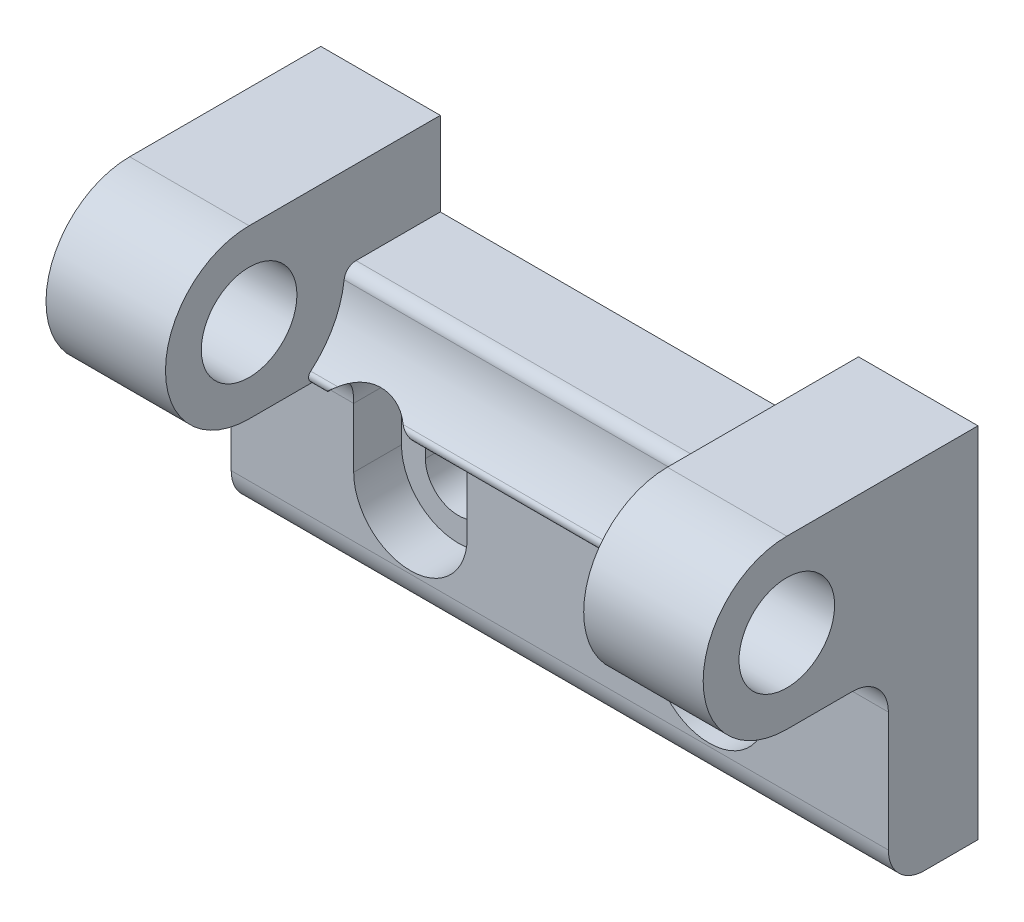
ISO-10303-21;
HEADER;
FILE_DESCRIPTION(('STEP AP214'),'2;1');
FILE_NAME('part.step','',(''),(''),'','','');
FILE_SCHEMA(('AUTOMOTIVE_DESIGN { 1 0 10303 214 1 1 1 1 }'));
ENDSEC;
DATA;
#1=APPLICATION_CONTEXT('core data for automotive mechanical design processes');
#2=APPLICATION_PROTOCOL_DEFINITION('international standard','automotive_design',2000,#1);
#3=PRODUCT_CONTEXT('',#1,'mechanical');
#4=PRODUCT('Part','Part','',(#3));
#5=PRODUCT_RELATED_PRODUCT_CATEGORY('part','',(#4));
#6=PRODUCT_DEFINITION_FORMATION('','',#4);
#7=PRODUCT_DEFINITION_CONTEXT('part definition',#1,'design');
#8=PRODUCT_DEFINITION('design','',#6,#7);
#9=PRODUCT_DEFINITION_SHAPE('','',#8);
#10=(LENGTH_UNIT() NAMED_UNIT(*) SI_UNIT(.MILLI.,.METRE.));
#11=(NAMED_UNIT(*) PLANE_ANGLE_UNIT() SI_UNIT($,.RADIAN.));
#12=(NAMED_UNIT(*) SI_UNIT($,.STERADIAN.) SOLID_ANGLE_UNIT());
#13=UNCERTAINTY_MEASURE_WITH_UNIT(LENGTH_MEASURE(1.E-05),#10,'distance_accuracy_value','');
#14=(GEOMETRIC_REPRESENTATION_CONTEXT(3) GLOBAL_UNCERTAINTY_ASSIGNED_CONTEXT((#13)) GLOBAL_UNIT_ASSIGNED_CONTEXT((#10,
#11,#12)) REPRESENTATION_CONTEXT('',''));
#15=CARTESIAN_POINT('',(0.,0.,0.));
#16=DIRECTION('',(0.,0.,1.));
#17=DIRECTION('',(1.,0.,0.));
#18=AXIS2_PLACEMENT_3D('',#15,#16,#17);
#19=CARTESIAN_POINT('',(0.,0.,3.5));
#20=DIRECTION('',(0.,0.,-1.));
#21=DIRECTION('',(-1.,0.,0.));
#22=AXIS2_PLACEMENT_3D('',#19,#20,#21);
#23=CYLINDRICAL_SURFACE('',#22,4.75);
#24=DIRECTION('',(0.,0.,-1.));
#25=VECTOR('',#24,1.);
#26=CARTESIAN_POINT('',(4.75,0.,3.5));
#27=LINE('',#26,#25);
#28=CARTESIAN_POINT('',(4.75,0.,3.5));
#29=VERTEX_POINT('',#28);
#30=CARTESIAN_POINT('',(4.75,0.,7.5));
#31=VERTEX_POINT('',#30);
#32=EDGE_CURVE('E447',#29,#31,#27,.F.);
#33=ORIENTED_EDGE('',*,*,#32,.F.);
#34=CARTESIAN_POINT('',(0.,0.,3.5));
#35=DIRECTION('',(0.,0.,-1.));
#36=DIRECTION('',(-1.,0.,0.));
#37=AXIS2_PLACEMENT_3D('',#34,#35,#36);
#38=CIRCLE('',#37,4.75);
#39=CARTESIAN_POINT('',(-4.75,0.,3.5));
#40=VERTEX_POINT('',#39);
#41=EDGE_CURVE('E424',#40,#29,#38,.F.);
#42=ORIENTED_EDGE('',*,*,#41,.F.);
#43=DIRECTION('',(0.,0.,1.));
#44=VECTOR('',#43,1.);
#45=CARTESIAN_POINT('',(-4.75,0.,3.5));
#46=LINE('',#45,#44);
#47=CARTESIAN_POINT('',(-4.75,0.,7.5));
#48=VERTEX_POINT('',#47);
#49=EDGE_CURVE('E440',#40,#48,#46,.T.);
#50=ORIENTED_EDGE('',*,*,#49,.T.);
#51=CARTESIAN_POINT('',(0.,0.,7.5));
#52=DIRECTION('',(0.,0.,-1.));
#53=DIRECTION('',(-1.,0.,0.));
#54=AXIS2_PLACEMENT_3D('',#51,#52,#53);
#55=CIRCLE('',#54,4.75);
#56=EDGE_CURVE('E550',#31,#48,#55,.T.);
#57=ORIENTED_EDGE('',*,*,#56,.F.);
#58=EDGE_LOOP('',(#33,#42,#50,#57));
#59=FACE_BOUND('',#58,.T.);
#60=ADVANCED_FACE('F14',(#59),#23,.F.);
#61=CARTESIAN_POINT('',(25.,0.,3.5));
#62=DIRECTION('',(0.,0.,-1.));
#63=DIRECTION('',(-1.,0.,0.));
#64=AXIS2_PLACEMENT_3D('',#61,#62,#63);
#65=CYLINDRICAL_SURFACE('',#64,4.75);
#66=DIRECTION('',(0.,0.,-1.));
#67=VECTOR('',#66,1.);
#68=CARTESIAN_POINT('',(29.75,0.,3.5));
#69=LINE('',#68,#67);
#70=CARTESIAN_POINT('',(29.75,0.,3.5));
#71=VERTEX_POINT('',#70);
#72=CARTESIAN_POINT('',(29.75,0.,7.5));
#73=VERTEX_POINT('',#72);
#74=EDGE_CURVE('E464',#71,#73,#69,.F.);
#75=ORIENTED_EDGE('',*,*,#74,.F.);
#76=CARTESIAN_POINT('',(25.,0.,3.5));
#77=DIRECTION('',(0.,0.,-1.));
#78=DIRECTION('',(-1.,0.,0.));
#79=AXIS2_PLACEMENT_3D('',#76,#77,#78);
#80=CIRCLE('',#79,4.75);
#81=CARTESIAN_POINT('',(20.25,0.,3.5));
#82=VERTEX_POINT('',#81);
#83=EDGE_CURVE('E432',#82,#71,#80,.F.);
#84=ORIENTED_EDGE('',*,*,#83,.F.);
#85=DIRECTION('',(0.,0.,1.));
#86=VECTOR('',#85,1.);
#87=CARTESIAN_POINT('',(20.25,0.,3.5));
#88=LINE('',#87,#86);
#89=CARTESIAN_POINT('',(20.25,0.,7.5));
#90=VERTEX_POINT('',#89);
#91=EDGE_CURVE('E460',#82,#90,#88,.T.);
#92=ORIENTED_EDGE('',*,*,#91,.T.);
#93=CARTESIAN_POINT('',(25.,0.,7.5));
#94=DIRECTION('',(0.,0.,-1.));
#95=DIRECTION('',(-1.,0.,0.));
#96=AXIS2_PLACEMENT_3D('',#93,#94,#95);
#97=CIRCLE('',#96,4.75);
#98=EDGE_CURVE('E336',#73,#90,#97,.T.);
#99=ORIENTED_EDGE('',*,*,#98,.F.);
#100=EDGE_LOOP('',(#75,#84,#92,#99));
#101=FACE_BOUND('',#100,.T.);
#102=ADVANCED_FACE('F388',(#101),#65,.F.);
#103=CARTESIAN_POINT('',(29.75,5.,3.5));
#104=DIRECTION('',(1.,0.,0.));
#105=DIRECTION('',(0.,1.,0.));
#106=AXIS2_PLACEMENT_3D('',#103,#104,#105);
#107=PLANE('',#106);
#108=DIRECTION('',(0.,0.,1.));
#109=VECTOR('',#108,1.);
#110=CARTESIAN_POINT('',(29.75,5.,3.5));
#111=LINE('',#110,#109);
#112=CARTESIAN_POINT('',(29.75,5.,3.5));
#113=VERTEX_POINT('',#112);
#114=CARTESIAN_POINT('',(29.75,5.,7.5));
#115=VERTEX_POINT('',#114);
#116=EDGE_CURVE('E466',#113,#115,#111,.T.);
#117=ORIENTED_EDGE('',*,*,#116,.F.);
#118=DIRECTION('',(0.,1.,0.));
#119=VECTOR('',#118,1.);
#120=CARTESIAN_POINT('',(29.75,15.,3.5));
#121=LINE('',#120,#119);
#122=EDGE_CURVE('E431',#71,#113,#121,.T.);
#123=ORIENTED_EDGE('',*,*,#122,.F.);
#124=ORIENTED_EDGE('',*,*,#74,.T.);
#125=DIRECTION('',(0.,1.,0.));
#126=VECTOR('',#125,1.);
#127=CARTESIAN_POINT('',(29.75,5.,7.5));
#128=LINE('',#127,#126);
#129=EDGE_CURVE('E334',#115,#73,#128,.F.);
#130=ORIENTED_EDGE('',*,*,#129,.F.);
#131=EDGE_LOOP('',(#117,#123,#124,#130));
#132=FACE_BOUND('',#131,.T.);
#133=ADVANCED_FACE('F344',(#132),#107,.F.);
#134=CARTESIAN_POINT('',(20.25,0.,3.5));
#135=DIRECTION('',(-1.,0.,0.));
#136=DIRECTION('',(0.,-1.,0.));
#137=AXIS2_PLACEMENT_3D('',#134,#135,#136);
#138=PLANE('',#137);
#139=ORIENTED_EDGE('',*,*,#91,.F.);
#140=DIRECTION('',(0.,1.,0.));
#141=VECTOR('',#140,1.);
#142=CARTESIAN_POINT('',(20.25,15.,3.5));
#143=LINE('',#142,#141);
#144=CARTESIAN_POINT('',(20.25,5.,3.5));
#145=VERTEX_POINT('',#144);
#146=EDGE_CURVE('E427',#145,#82,#143,.F.);
#147=ORIENTED_EDGE('',*,*,#146,.F.);
#148=DIRECTION('',(0.,0.,1.));
#149=VECTOR('',#148,1.);
#150=CARTESIAN_POINT('',(20.25,5.,3.5));
#151=LINE('',#150,#149);
#152=CARTESIAN_POINT('',(20.25,5.,7.5));
#153=VERTEX_POINT('',#152);
#154=EDGE_CURVE('E462',#153,#145,#151,.F.);
#155=ORIENTED_EDGE('',*,*,#154,.F.);
#156=DIRECTION('',(0.,1.,0.));
#157=VECTOR('',#156,1.);
#158=CARTESIAN_POINT('',(20.25,5.,7.5));
#159=LINE('',#158,#157);
#160=EDGE_CURVE('E459',#90,#153,#159,.T.);
#161=ORIENTED_EDGE('',*,*,#160,.F.);
#162=EDGE_LOOP('',(#139,#147,#155,#161));
#163=FACE_BOUND('',#162,.T.);
#164=ADVANCED_FACE('F379',(#163),#138,.F.);
#165=CARTESIAN_POINT('',(40.,5.,10.5));
#166=DIRECTION('',(1.,0.,0.));
#167=DIRECTION('',(0.,1.,0.));
#168=AXIS2_PLACEMENT_3D('',#165,#166,#167);
#169=CYLINDRICAL_SURFACE('',#168,3.);
#170=DIRECTION('',(1.,0.,0.));
#171=VECTOR('',#170,1.);
#172=CARTESIAN_POINT('',(40.,7.99993599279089,10.519596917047));
#173=LINE('',#172,#171);
#174=CARTESIAN_POINT('',(3.68278210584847,7.99993599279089,10.519596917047));
#175=VERTEX_POINT('',#174);
#176=CARTESIAN_POINT('',(21.3172178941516,7.99993599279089,10.519596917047));
#177=VERTEX_POINT('',#176);
#178=EDGE_CURVE('E368',#175,#177,#173,.T.);
#179=ORIENTED_EDGE('',*,*,#178,.F.);
#180=CARTESIAN_POINT('',(4.75,5.,7.5));
#181=CARTESIAN_POINT('',(4.75001584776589,5.07644387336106,7.49998560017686));
#182=CARTESIAN_POINT('',(4.74815509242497,5.15287698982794,7.50292136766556));
#183=CARTESIAN_POINT('',(4.74080013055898,5.3050846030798,7.51458156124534));
#184=CARTESIAN_POINT('',(4.73530786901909,5.3808594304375,7.52330288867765));
#185=CARTESIAN_POINT('',(4.72085123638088,5.53076278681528,7.5463560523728));
#186=CARTESIAN_POINT('',(4.71190707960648,5.60489829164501,7.56065522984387));
#187=CARTESIAN_POINT('',(4.69077176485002,5.75143151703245,7.59465748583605));
#188=CARTESIAN_POINT('',(4.67858031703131,5.82382908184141,7.61436104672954));
#189=CARTESIAN_POINT('',(4.63758030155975,6.03743528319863,7.6811513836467));
#190=CARTESIAN_POINT('',(4.60430519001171,6.1754586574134,7.73598107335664));
#191=CARTESIAN_POINT('',(4.52858280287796,6.43994897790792,7.86405197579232));
#192=CARTESIAN_POINT('',(4.48612496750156,6.56640237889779,7.93731440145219));
#193=CARTESIAN_POINT('',(4.39152950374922,6.81551315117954,8.10660039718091));
#194=CARTESIAN_POINT('',(4.33888948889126,6.93705975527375,8.20397495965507));
#195=CARTESIAN_POINT('',(4.2306966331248,7.16320777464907,8.41563621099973));
#196=CARTESIAN_POINT('',(4.17513921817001,7.26778146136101,8.52995000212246));
#197=CARTESIAN_POINT('',(4.05807921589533,7.47187486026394,8.79090098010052));
#198=CARTESIAN_POINT('',(3.99683277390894,7.56863900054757,8.93982287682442));
#199=CARTESIAN_POINT('',(3.88466785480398,7.73531684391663,9.25517197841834));
#200=CARTESIAN_POINT('',(3.83371084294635,7.80533163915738,9.42153018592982));
#201=CARTESIAN_POINT('',(3.77490825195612,7.88329742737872,9.66784265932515));
#202=CARTESIAN_POINT('',(3.75917405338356,7.90372346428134,9.74212147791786));
#203=CARTESIAN_POINT('',(3.73172815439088,7.93891157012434,9.89273535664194));
#204=CARTESIAN_POINT('',(3.72001480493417,7.95367596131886,9.96906955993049));
#205=CARTESIAN_POINT('',(3.70107249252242,7.97738327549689,10.1239923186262));
#206=CARTESIAN_POINT('',(3.69388990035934,7.98626604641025,10.2025958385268));
#207=CARTESIAN_POINT('',(3.68450687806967,7.99781791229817,10.360667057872));
#208=CARTESIAN_POINT('',(3.68231387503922,8.00047774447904,10.440135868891));
#209=CARTESIAN_POINT('',(3.68278210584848,7.99993599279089,10.519596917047));
#210=B_SPLINE_CURVE_WITH_KNOTS('',3,(#180,#181,#182,#183,#184,#185,#186,#187,#188,#189,#190,
#191,#192,#193,#194,#195,#196,#197,#198,#199,#200,#201,#202,#203,#204,#205,#206,#207,#208,#209),
.UNSPECIFIED.,.F.,.F.,(4,2,2,2,2,2,2,2,2,2,2,2,2,2,4),(0.,0.229234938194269,0.458347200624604,
0.686137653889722,0.913948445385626,1.36836096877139,1.82329885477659,2.31458977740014,
2.80667541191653,3.3676296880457,3.92644250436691,4.16205421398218,4.39756917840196,
4.63545703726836,4.87369876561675),.UNSPECIFIED.);
#211=CARTESIAN_POINT('',(4.75,5.,7.5));
#212=VERTEX_POINT('',#211);
#213=EDGE_CURVE('E274',#212,#175,#210,.T.);
#214=ORIENTED_EDGE('',*,*,#213,.F.);
#215=DIRECTION('',(1.,0.,0.));
#216=VECTOR('',#215,1.);
#217=CARTESIAN_POINT('',(40.,5.,7.5));
#218=LINE('',#217,#216);
#219=EDGE_CURVE('E455',#153,#212,#218,.F.);
#220=ORIENTED_EDGE('',*,*,#219,.F.);
#221=CARTESIAN_POINT('',(21.3172178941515,7.99993599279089,10.519596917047));
#222=CARTESIAN_POINT('',(21.3176506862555,8.00044135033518,10.4449864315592));
#223=CARTESIAN_POINT('',(21.3157456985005,7.99812804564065,10.3703650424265));
#224=CARTESIAN_POINT('',(21.3075130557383,7.98799661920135,10.2218218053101));
#225=CARTESIAN_POINT('',(21.30119024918,7.98018453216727,10.1478992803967));
#226=CARTESIAN_POINT('',(21.2844497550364,7.95928228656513,10.0019629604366));
#227=CARTESIAN_POINT('',(21.2740691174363,7.9462398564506,9.92993801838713));
#228=CARTESIAN_POINT('',(21.2496589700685,7.91510455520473,9.78762613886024));
#229=CARTESIAN_POINT('',(21.2356286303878,7.8970105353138,9.71733960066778));
#230=CARTESIAN_POINT('',(21.1889647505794,7.83569127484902,9.51031282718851));
#231=CARTESIAN_POINT('',(21.1516652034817,7.78532010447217,9.37667147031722));
#232=CARTESIAN_POINT('',(21.0689933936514,7.66737164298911,9.11970053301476));
#233=CARTESIAN_POINT('',(21.0236007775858,7.5997507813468,8.99639813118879));
#234=CARTESIAN_POINT('',(20.9225898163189,7.43873023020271,8.74568041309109));
#235=CARTESIAN_POINT('',(20.8664159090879,7.34309190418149,8.61992223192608));
#236=CARTESIAN_POINT('',(20.7543167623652,7.1332770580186,8.38481545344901));
#237=CARTESIAN_POINT('',(20.6983916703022,7.01909074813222,8.27547558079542));
#238=CARTESIAN_POINT('',(20.5843614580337,6.75713651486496,8.06185144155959));
#239=CARTESIAN_POINT('',(20.5269387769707,6.60692657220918,7.96012823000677));
#240=CARTESIAN_POINT('',(20.4503468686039,6.36755839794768,7.82827826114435));
#241=CARTESIAN_POINT('',(20.4264143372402,6.28546283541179,7.78779626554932));
#242=CARTESIAN_POINT('',(20.3824009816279,6.11706171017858,7.71421539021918));
#243=CARTESIAN_POINT('',(20.3623173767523,6.03075924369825,7.68111117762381));
#244=CARTESIAN_POINT('',(20.3293551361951,5.86798307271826,7.62723058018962));
#245=CARTESIAN_POINT('',(20.3158459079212,5.79200120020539,7.60534633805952));
#246=CARTESIAN_POINT('',(20.2924022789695,5.63803302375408,7.56756158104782));
#247=CARTESIAN_POINT('',(20.2824670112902,5.56004721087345,7.5516596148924));
#248=CARTESIAN_POINT('',(20.2663833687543,5.40212271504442,7.52599041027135));
#249=CARTESIAN_POINT('',(20.2602616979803,5.32217424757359,7.51626642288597));
#250=CARTESIAN_POINT('',(20.2520583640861,5.16148832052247,7.50325946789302));
#251=CARTESIAN_POINT('',(20.2499798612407,5.08075029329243,7.49998153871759));
#252=CARTESIAN_POINT('',(20.25,5.,7.5));
#253=B_SPLINE_CURVE_WITH_KNOTS('',3,(#221,#222,#223,#224,#225,#226,#227,#228,#229,#230,#231,
#232,#233,#234,#235,#236,#237,#238,#239,#240,#241,#242,#243,#244,#245,#246,#247,#248,#249,#250,
#251,#252),.UNSPECIFIED.,.F.,.F.,(4,2,2,2,2,2,2,2,2,2,2,2,2,2,2,4),(0.,0.223719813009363,
0.447194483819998,0.668674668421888,0.890205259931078,1.33105175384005,1.77302299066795,
2.27413042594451,2.77550321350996,3.34288818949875,3.62635148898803,3.90960922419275,
4.14995248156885,4.39023739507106,4.63218648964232,4.87432462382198),.UNSPECIFIED.);
#254=EDGE_CURVE('E360',#177,#153,#253,.T.);
#255=ORIENTED_EDGE('',*,*,#254,.F.);
#256=EDGE_LOOP('',(#179,#214,#220,#255));
#257=FACE_BOUND('',#256,.T.);
#258=ADVANCED_FACE('F373',(#257),#169,.F.);
#259=CARTESIAN_POINT('',(4.75,5.,3.5));
#260=DIRECTION('',(1.,0.,0.));
#261=DIRECTION('',(0.,1.,0.));
#262=AXIS2_PLACEMENT_3D('',#259,#260,#261);
#263=PLANE('',#262);
#264=DIRECTION('',(0.,0.,1.));
#265=VECTOR('',#264,1.);
#266=CARTESIAN_POINT('',(4.75,5.,3.5));
#267=LINE('',#266,#265);
#268=CARTESIAN_POINT('',(4.75,5.,3.5));
#269=VERTEX_POINT('',#268);
#270=EDGE_CURVE('E367',#269,#212,#267,.T.);
#271=ORIENTED_EDGE('',*,*,#270,.F.);
#272=DIRECTION('',(0.,1.,0.));
#273=VECTOR('',#272,1.);
#274=CARTESIAN_POINT('',(4.75,15.,3.5));
#275=LINE('',#274,#273);
#276=EDGE_CURVE('E423',#29,#269,#275,.T.);
#277=ORIENTED_EDGE('',*,*,#276,.F.);
#278=ORIENTED_EDGE('',*,*,#32,.T.);
#279=DIRECTION('',(0.,1.,0.));
#280=VECTOR('',#279,1.);
#281=CARTESIAN_POINT('',(4.75,5.,7.5));
#282=LINE('',#281,#280);
#283=EDGE_CURVE('E458',#212,#31,#282,.F.);
#284=ORIENTED_EDGE('',*,*,#283,.F.);
#285=EDGE_LOOP('',(#271,#277,#278,#284));
#286=FACE_BOUND('',#285,.T.);
#287=ADVANCED_FACE('F378',(#286),#263,.F.);
#288=CARTESIAN_POINT('',(-4.75,0.,3.5));
#289=DIRECTION('',(-1.,0.,0.));
#290=DIRECTION('',(0.,-1.,0.));
#291=AXIS2_PLACEMENT_3D('',#288,#289,#290);
#292=PLANE('',#291);
#293=ORIENTED_EDGE('',*,*,#49,.F.);
#294=DIRECTION('',(0.,1.,0.));
#295=VECTOR('',#294,1.);
#296=CARTESIAN_POINT('',(-4.75,15.,3.5));
#297=LINE('',#296,#295);
#298=CARTESIAN_POINT('',(-4.75,5.,3.5));
#299=VERTEX_POINT('',#298);
#300=EDGE_CURVE('E422',#299,#40,#297,.F.);
#301=ORIENTED_EDGE('',*,*,#300,.F.);
#302=DIRECTION('',(0.,0.,1.));
#303=VECTOR('',#302,1.);
#304=CARTESIAN_POINT('',(-4.75,5.,3.5));
#305=LINE('',#304,#303);
#306=CARTESIAN_POINT('',(-4.75,5.,7.5));
#307=VERTEX_POINT('',#306);
#308=EDGE_CURVE('E442',#307,#299,#305,.F.);
#309=ORIENTED_EDGE('',*,*,#308,.F.);
#310=DIRECTION('',(0.,1.,0.));
#311=VECTOR('',#310,1.);
#312=CARTESIAN_POINT('',(-4.75,5.,7.5));
#313=LINE('',#312,#311);
#314=EDGE_CURVE('E552',#48,#307,#313,.T.);
#315=ORIENTED_EDGE('',*,*,#314,.F.);
#316=EDGE_LOOP('',(#293,#301,#309,#315));
#317=FACE_BOUND('',#316,.T.);
#318=ADVANCED_FACE('F384',(#317),#292,.F.);
#319=CARTESIAN_POINT('',(12.5,15.,3.5));
#320=DIRECTION('',(0.,0.,1.));
#321=DIRECTION('',(1.,0.,0.));
#322=AXIS2_PLACEMENT_3D('',#319,#320,#321);
#323=PLANE('',#322);
#324=CARTESIAN_POINT('',(25.,5.,3.5));
#325=DIRECTION('',(0.,0.,-1.));
#326=DIRECTION('',(-1.,0.,0.));
#327=AXIS2_PLACEMENT_3D('',#324,#325,#326);
#328=CIRCLE('',#327,4.75);
#329=EDGE_CURVE('E428',#113,#145,#328,.F.);
#330=ORIENTED_EDGE('',*,*,#329,.T.);
#331=ORIENTED_EDGE('',*,*,#146,.T.);
#332=ORIENTED_EDGE('',*,*,#83,.T.);
#333=ORIENTED_EDGE('',*,*,#122,.T.);
#334=EDGE_LOOP('',(#330,#331,#332,#333));
#335=FACE_BOUND('',#334,.T.);
#336=DIRECTION('',(0.,-1.,0.));
#337=VECTOR('',#336,1.);
#338=CARTESIAN_POINT('',(22.25,0.,3.5));
#339=LINE('',#338,#337);
#340=CARTESIAN_POINT('',(22.25,0.,3.5));
#341=VERTEX_POINT('',#340);
#342=CARTESIAN_POINT('',(22.25,5.,3.5));
#343=VERTEX_POINT('',#342);
#344=EDGE_CURVE('E613',#341,#343,#339,.F.);
#345=ORIENTED_EDGE('',*,*,#344,.T.);
#346=CARTESIAN_POINT('',(25.,5.,3.5));
#347=DIRECTION('',(0.,0.,-1.));
#348=DIRECTION('',(-1.,0.,0.));
#349=AXIS2_PLACEMENT_3D('',#346,#347,#348);
#350=CIRCLE('',#349,2.75);
#351=CARTESIAN_POINT('',(27.75,5.,3.5));
#352=VERTEX_POINT('',#351);
#353=EDGE_CURVE('E541',#343,#352,#350,.T.);
#354=ORIENTED_EDGE('',*,*,#353,.T.);
#355=DIRECTION('',(0.,1.,0.));
#356=VECTOR('',#355,1.);
#357=CARTESIAN_POINT('',(27.75,5.,3.5));
#358=LINE('',#357,#356);
#359=CARTESIAN_POINT('',(27.75,0.,3.5));
#360=VERTEX_POINT('',#359);
#361=EDGE_CURVE('E450',#352,#360,#358,.F.);
#362=ORIENTED_EDGE('',*,*,#361,.T.);
#363=CARTESIAN_POINT('',(25.,0.,3.5));
#364=DIRECTION('',(0.,0.,-1.));
#365=DIRECTION('',(-1.,0.,0.));
#366=AXIS2_PLACEMENT_3D('',#363,#364,#365);
#367=CIRCLE('',#366,2.75);
#368=EDGE_CURVE('E546',#360,#341,#367,.T.);
#369=ORIENTED_EDGE('',*,*,#368,.T.);
#370=EDGE_LOOP('',(#345,#354,#362,#369));
#371=FACE_BOUND('',#370,.T.);
#372=ADVANCED_FACE('F391',(#335,#371),#323,.T.);
#373=CARTESIAN_POINT('',(12.5,15.,3.5));
#374=DIRECTION('',(0.,0.,1.));
#375=DIRECTION('',(1.,0.,0.));
#376=AXIS2_PLACEMENT_3D('',#373,#374,#375);
#377=PLANE('',#376);
#378=CARTESIAN_POINT('',(0.,5.,3.5));
#379=DIRECTION('',(0.,0.,-1.));
#380=DIRECTION('',(-1.,0.,0.));
#381=AXIS2_PLACEMENT_3D('',#378,#379,#380);
#382=CIRCLE('',#381,4.75);
#383=EDGE_CURVE('E419',#269,#299,#382,.F.);
#384=ORIENTED_EDGE('',*,*,#383,.T.);
#385=ORIENTED_EDGE('',*,*,#300,.T.);
#386=ORIENTED_EDGE('',*,*,#41,.T.);
#387=ORIENTED_EDGE('',*,*,#276,.T.);
#388=EDGE_LOOP('',(#384,#385,#386,#387));
#389=FACE_BOUND('',#388,.T.);
#390=DIRECTION('',(0.,-1.,0.));
#391=VECTOR('',#390,1.);
#392=CARTESIAN_POINT('',(-2.75,0.,3.5));
#393=LINE('',#392,#391);
#394=CARTESIAN_POINT('',(-2.75,0.,3.5));
#395=VERTEX_POINT('',#394);
#396=CARTESIAN_POINT('',(-2.75,5.,3.5));
#397=VERTEX_POINT('',#396);
#398=EDGE_CURVE('E544',#395,#397,#393,.F.);
#399=ORIENTED_EDGE('',*,*,#398,.T.);
#400=CARTESIAN_POINT('',(0.,5.,3.5));
#401=DIRECTION('',(0.,0.,-1.));
#402=DIRECTION('',(-1.,0.,0.));
#403=AXIS2_PLACEMENT_3D('',#400,#401,#402);
#404=CIRCLE('',#403,2.75);
#405=CARTESIAN_POINT('',(2.75,5.,3.5));
#406=VERTEX_POINT('',#405);
#407=EDGE_CURVE('E532',#397,#406,#404,.T.);
#408=ORIENTED_EDGE('',*,*,#407,.T.);
#409=DIRECTION('',(0.,1.,0.));
#410=VECTOR('',#409,1.);
#411=CARTESIAN_POINT('',(2.75,5.,3.5));
#412=LINE('',#411,#410);
#413=CARTESIAN_POINT('',(2.75,0.,3.5));
#414=VERTEX_POINT('',#413);
#415=EDGE_CURVE('E602',#406,#414,#412,.F.);
#416=ORIENTED_EDGE('',*,*,#415,.T.);
#417=CARTESIAN_POINT('',(0.,0.,3.5));
#418=DIRECTION('',(0.,0.,-1.));
#419=DIRECTION('',(-1.,0.,0.));
#420=AXIS2_PLACEMENT_3D('',#417,#418,#419);
#421=CIRCLE('',#420,2.75);
#422=EDGE_CURVE('E536',#414,#395,#421,.T.);
#423=ORIENTED_EDGE('',*,*,#422,.T.);
#424=EDGE_LOOP('',(#399,#408,#416,#423));
#425=FACE_BOUND('',#424,.T.);
#426=ADVANCED_FACE('F399',(#389,#425),#377,.T.);
#427=CARTESIAN_POINT('',(40.,-5.,4.5));
#428=DIRECTION('',(1.,0.,0.));
#429=DIRECTION('',(0.,1.,0.));
#430=AXIS2_PLACEMENT_3D('',#427,#428,#429);
#431=CYLINDRICAL_SURFACE('',#430,3.);
#432=CARTESIAN_POINT('',(40.,-5.,4.5));
#433=DIRECTION('',(1.,0.,0.));
#434=DIRECTION('',(0.,1.,0.));
#435=AXIS2_PLACEMENT_3D('',#432,#433,#434);
#436=CIRCLE('',#435,3.);
#437=CARTESIAN_POINT('',(40.,-5.,7.5));
#438=VERTEX_POINT('',#437);
#439=CARTESIAN_POINT('',(40.,-8.,4.5));
#440=VERTEX_POINT('',#439);
#441=EDGE_CURVE('E490',#438,#440,#436,.T.);
#442=ORIENTED_EDGE('',*,*,#441,.F.);
#443=DIRECTION('',(1.,0.,0.));
#444=VECTOR('',#443,1.);
#445=CARTESIAN_POINT('',(40.,-5.,7.5));
#446=LINE('',#445,#444);
#447=CARTESIAN_POINT('',(-15.,-5.,7.5));
#448=VERTEX_POINT('',#447);
#449=EDGE_CURVE('E638',#438,#448,#446,.F.);
#450=ORIENTED_EDGE('',*,*,#449,.T.);
#451=CARTESIAN_POINT('',(-15.,-5.,4.5));
#452=DIRECTION('',(1.,0.,0.));
#453=DIRECTION('',(0.,1.,0.));
#454=AXIS2_PLACEMENT_3D('',#451,#452,#453);
#455=CIRCLE('',#454,3.);
#456=CARTESIAN_POINT('',(-15.,-8.,4.5));
#457=VERTEX_POINT('',#456);
#458=EDGE_CURVE('E526',#448,#457,#455,.T.);
#459=ORIENTED_EDGE('',*,*,#458,.T.);
#460=DIRECTION('',(1.,0.,0.));
#461=VECTOR('',#460,1.);
#462=CARTESIAN_POINT('',(40.,-8.,4.5));
#463=LINE('',#462,#461);
#464=EDGE_CURVE('E599',#440,#457,#463,.F.);
#465=ORIENTED_EDGE('',*,*,#464,.F.);
#466=EDGE_LOOP('',(#442,#450,#459,#465));
#467=FACE_BOUND('',#466,.T.);
#468=ADVANCED_FACE('F403',(#467),#431,.T.);
#469=CARTESIAN_POINT('',(40.,5.,7.5));
#470=DIRECTION('',(0.,0.,1.));
#471=DIRECTION('',(1.,0.,0.));
#472=AXIS2_PLACEMENT_3D('',#469,#470,#471);
#473=PLANE('',#472);
#474=DIRECTION('',(0.,1.,0.));
#475=VECTOR('',#474,1.);
#476=CARTESIAN_POINT('',(40.,15.,7.5));
#477=LINE('',#476,#475);
#478=CARTESIAN_POINT('',(40.,5.,7.5));
#479=VERTEX_POINT('',#478);
#480=EDGE_CURVE('E492',#479,#438,#477,.F.);
#481=ORIENTED_EDGE('',*,*,#480,.F.);
#482=DIRECTION('',(1.,0.,0.));
#483=VECTOR('',#482,1.);
#484=CARTESIAN_POINT('',(40.,5.,7.5));
#485=LINE('',#484,#483);
#486=EDGE_CURVE('E641',#479,#115,#485,.F.);
#487=ORIENTED_EDGE('',*,*,#486,.T.);
#488=ORIENTED_EDGE('',*,*,#129,.T.);
#489=ORIENTED_EDGE('',*,*,#98,.T.);
#490=ORIENTED_EDGE('',*,*,#160,.T.);
#491=ORIENTED_EDGE('',*,*,#219,.T.);
#492=ORIENTED_EDGE('',*,*,#283,.T.);
#493=ORIENTED_EDGE('',*,*,#56,.T.);
#494=ORIENTED_EDGE('',*,*,#314,.T.);
#495=DIRECTION('',(1.,0.,0.));
#496=VECTOR('',#495,1.);
#497=CARTESIAN_POINT('',(40.,5.,7.5));
#498=LINE('',#497,#496);
#499=CARTESIAN_POINT('',(-15.,5.,7.5));
#500=VERTEX_POINT('',#499);
#501=EDGE_CURVE('E556',#307,#500,#498,.F.);
#502=ORIENTED_EDGE('',*,*,#501,.T.);
#503=DIRECTION('',(0.,1.,0.));
#504=VECTOR('',#503,1.);
#505=CARTESIAN_POINT('',(-15.,15.,7.5));
#506=LINE('',#505,#504);
#507=EDGE_CURVE('E528',#500,#448,#506,.F.);
#508=ORIENTED_EDGE('',*,*,#507,.T.);
#509=ORIENTED_EDGE('',*,*,#449,.F.);
#510=EDGE_LOOP('',(#481,#487,#488,#489,#490,#491,#492,#493,#494,#502,#508,#509));
#511=FACE_BOUND('',#510,.T.);
#512=ADVANCED_FACE('F325',(#511),#473,.T.);
#513=CARTESIAN_POINT('',(40.,5.,10.5));
#514=DIRECTION('',(1.,0.,0.));
#515=DIRECTION('',(0.,1.,0.));
#516=AXIS2_PLACEMENT_3D('',#513,#514,#515);
#517=CYLINDRICAL_SURFACE('',#516,3.);
#518=DIRECTION('',(1.,0.,0.));
#519=VECTOR('',#518,1.);
#520=CARTESIAN_POINT('',(40.,7.99993599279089,10.519596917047));
#521=LINE('',#520,#519);
#522=CARTESIAN_POINT('',(-15.,7.99993599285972,10.5195969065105));
#523=VERTEX_POINT('',#522);
#524=CARTESIAN_POINT('',(-3.6827821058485,7.99993599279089,10.519596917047));
#525=VERTEX_POINT('',#524);
#526=EDGE_CURVE('E418',#523,#525,#521,.T.);
#527=ORIENTED_EDGE('',*,*,#526,.F.);
#528=CARTESIAN_POINT('',(-15.,5.,10.5));
#529=DIRECTION('',(1.,0.,0.));
#530=DIRECTION('',(0.,1.,0.));
#531=AXIS2_PLACEMENT_3D('',#528,#529,#530);
#532=CIRCLE('',#531,3.);
#533=EDGE_CURVE('E519',#523,#500,#532,.F.);
#534=ORIENTED_EDGE('',*,*,#533,.T.);
#535=ORIENTED_EDGE('',*,*,#501,.F.);
#536=CARTESIAN_POINT('',(-3.6827821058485,7.99993599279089,10.519596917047));
#537=CARTESIAN_POINT('',(-3.68234931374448,8.00044135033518,10.4449864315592));
#538=CARTESIAN_POINT('',(-3.68425430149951,7.99812804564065,10.3703650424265));
#539=CARTESIAN_POINT('',(-3.69248694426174,7.98799661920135,10.2218218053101));
#540=CARTESIAN_POINT('',(-3.69880975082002,7.98018453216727,10.1478992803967));
#541=CARTESIAN_POINT('',(-3.71555024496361,7.95928228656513,10.0019629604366));
#542=CARTESIAN_POINT('',(-3.72593088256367,7.9462398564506,9.92993801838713));
#543=CARTESIAN_POINT('',(-3.7503410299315,7.91510455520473,9.78762613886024));
#544=CARTESIAN_POINT('',(-3.76437136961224,7.8970105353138,9.71733960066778));
#545=CARTESIAN_POINT('',(-3.81103524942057,7.83569127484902,9.51031282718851));
#546=CARTESIAN_POINT('',(-3.84833479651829,7.78532010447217,9.37667147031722));
#547=CARTESIAN_POINT('',(-3.93100660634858,7.66737164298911,9.11970053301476));
#548=CARTESIAN_POINT('',(-3.97639922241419,7.5997507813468,8.99639813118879));
#549=CARTESIAN_POINT('',(-4.07741018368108,7.43873023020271,8.74568041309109));
#550=CARTESIAN_POINT('',(-4.13358409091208,7.34309190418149,8.61992223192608));
#551=CARTESIAN_POINT('',(-4.24568323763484,7.1332770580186,8.38481545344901));
#552=CARTESIAN_POINT('',(-4.30160832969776,7.01909074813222,8.27547558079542));
#553=CARTESIAN_POINT('',(-4.41563854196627,6.75713651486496,8.06185144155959));
#554=CARTESIAN_POINT('',(-4.47306122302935,6.60692657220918,7.96012823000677));
#555=CARTESIAN_POINT('',(-4.5496531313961,6.36755839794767,7.82827826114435));
#556=CARTESIAN_POINT('',(-4.57358566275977,6.28546283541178,7.78779626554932));
#557=CARTESIAN_POINT('',(-4.61759901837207,6.11706171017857,7.71421539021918));
#558=CARTESIAN_POINT('',(-4.63768262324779,6.03075924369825,7.68111117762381));
#559=CARTESIAN_POINT('',(-4.67064486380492,5.86798307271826,7.62723058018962));
#560=CARTESIAN_POINT('',(-4.68415409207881,5.79200120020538,7.60534633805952));
#561=CARTESIAN_POINT('',(-4.7075977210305,5.63803302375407,7.56756158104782));
#562=CARTESIAN_POINT('',(-4.71753298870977,5.56004721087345,7.5516596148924));
#563=CARTESIAN_POINT('',(-4.73361663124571,5.40212271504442,7.52599041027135));
#564=CARTESIAN_POINT('',(-4.7397383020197,5.32217424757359,7.51626642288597));
#565=CARTESIAN_POINT('',(-4.7479416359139,5.16148832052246,7.50325946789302));
#566=CARTESIAN_POINT('',(-4.75002013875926,5.08075029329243,7.49998153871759));
#567=CARTESIAN_POINT('',(-4.75,5.,7.5));
#568=B_SPLINE_CURVE_WITH_KNOTS('',3,(#536,#537,#538,#539,#540,#541,#542,#543,#544,#545,#546,
#547,#548,#549,#550,#551,#552,#553,#554,#555,#556,#557,#558,#559,#560,#561,#562,#563,#564,#565,
#566,#567),.UNSPECIFIED.,.F.,.F.,(4,2,2,2,2,2,2,2,2,2,2,2,2,2,2,4),(0.,0.223719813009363,
0.447194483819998,0.668674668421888,0.890205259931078,1.33105175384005,1.77302299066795,
2.27413042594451,2.77550321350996,3.34288818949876,3.62635148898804,3.90960922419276,
4.14995248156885,4.39023739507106,4.63218648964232,4.87432462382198),.UNSPECIFIED.);
#569=EDGE_CURVE('E411',#525,#307,#568,.T.);
#570=ORIENTED_EDGE('',*,*,#569,.F.);
#571=EDGE_LOOP('',(#527,#534,#535,#570));
#572=FACE_BOUND('',#571,.T.);
#573=ADVANCED_FACE('F323',(#572),#517,.F.);
#574=CARTESIAN_POINT('',(40.,5.,10.5));
#575=DIRECTION('',(1.,0.,0.));
#576=DIRECTION('',(0.,1.,0.));
#577=AXIS2_PLACEMENT_3D('',#574,#575,#576);
#578=CYLINDRICAL_SURFACE('',#577,3.);
#579=ORIENTED_EDGE('',*,*,#486,.F.);
#580=CARTESIAN_POINT('',(40.,5.,10.5));
#581=DIRECTION('',(1.,0.,0.));
#582=DIRECTION('',(0.,1.,0.));
#583=AXIS2_PLACEMENT_3D('',#580,#581,#582);
#584=CIRCLE('',#583,3.);
#585=CARTESIAN_POINT('',(40.,7.99993599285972,10.5195969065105));
#586=VERTEX_POINT('',#585);
#587=EDGE_CURVE('E493',#586,#479,#584,.F.);
#588=ORIENTED_EDGE('',*,*,#587,.F.);
#589=DIRECTION('',(1.,0.,0.));
#590=VECTOR('',#589,1.);
#591=CARTESIAN_POINT('',(40.,7.99993599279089,10.519596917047));
#592=LINE('',#591,#590);
#593=CARTESIAN_POINT('',(28.6827821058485,7.99993599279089,10.519596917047));
#594=VERTEX_POINT('',#593);
#595=EDGE_CURVE('E335',#594,#586,#592,.T.);
#596=ORIENTED_EDGE('',*,*,#595,.F.);
#597=CARTESIAN_POINT('',(29.75,5.,7.5));
#598=CARTESIAN_POINT('',(29.7500158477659,5.07644387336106,7.49998560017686));
#599=CARTESIAN_POINT('',(29.748155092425,5.15287698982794,7.50292136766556));
#600=CARTESIAN_POINT('',(29.740800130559,5.3050846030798,7.51458156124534));
#601=CARTESIAN_POINT('',(29.7353078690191,5.3808594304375,7.52330288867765));
#602=CARTESIAN_POINT('',(29.7208512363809,5.53076278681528,7.54635605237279));
#603=CARTESIAN_POINT('',(29.7119070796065,5.60489829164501,7.56065522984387));
#604=CARTESIAN_POINT('',(29.69077176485,5.75143151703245,7.59465748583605));
#605=CARTESIAN_POINT('',(29.6785803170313,5.82382908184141,7.61436104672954));
#606=CARTESIAN_POINT('',(29.6375803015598,6.03743528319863,7.6811513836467));
#607=CARTESIAN_POINT('',(29.6043051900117,6.1754586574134,7.73598107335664));
#608=CARTESIAN_POINT('',(29.528582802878,6.43994897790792,7.86405197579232));
#609=CARTESIAN_POINT('',(29.4861249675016,6.56640237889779,7.93731440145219));
#610=CARTESIAN_POINT('',(29.3915295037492,6.81551315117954,8.10660039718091));
#611=CARTESIAN_POINT('',(29.3388894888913,6.93705975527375,8.20397495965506));
#612=CARTESIAN_POINT('',(29.2306966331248,7.16320777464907,8.41563621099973));
#613=CARTESIAN_POINT('',(29.17513921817,7.26778146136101,8.52995000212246));
#614=CARTESIAN_POINT('',(29.0580792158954,7.47187486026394,8.79090098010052));
#615=CARTESIAN_POINT('',(28.9968327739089,7.56863900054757,8.93982287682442));
#616=CARTESIAN_POINT('',(28.884667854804,7.73531684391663,9.25517197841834));
#617=CARTESIAN_POINT('',(28.8337108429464,7.80533163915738,9.42153018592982));
#618=CARTESIAN_POINT('',(28.7749082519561,7.88329742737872,9.66784265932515));
#619=CARTESIAN_POINT('',(28.7591740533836,7.90372346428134,9.74212147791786));
#620=CARTESIAN_POINT('',(28.7317281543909,7.93891157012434,9.89273535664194));
#621=CARTESIAN_POINT('',(28.7200148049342,7.95367596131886,9.96906955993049));
#622=CARTESIAN_POINT('',(28.7010724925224,7.97738327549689,10.1239923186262));
#623=CARTESIAN_POINT('',(28.6938899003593,7.98626604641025,10.2025958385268));
#624=CARTESIAN_POINT('',(28.6845068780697,7.99781791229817,10.360667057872));
#625=CARTESIAN_POINT('',(28.6823138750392,8.00047774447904,10.440135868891));
#626=CARTESIAN_POINT('',(28.6827821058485,7.99993599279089,10.519596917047));
#627=B_SPLINE_CURVE_WITH_KNOTS('',3,(#597,#598,#599,#600,#601,#602,#603,#604,#605,#606,#607,
#608,#609,#610,#611,#612,#613,#614,#615,#616,#617,#618,#619,#620,#621,#622,#623,#624,#625,#626),
.UNSPECIFIED.,.F.,.F.,(4,2,2,2,2,2,2,2,2,2,2,2,2,2,4),(0.,0.229234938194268,0.458347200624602,
0.686137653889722,0.913948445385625,1.36836096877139,1.82329885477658,2.31458977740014,
2.80667541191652,3.3676296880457,3.92644250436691,4.16205421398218,4.39756917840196,
4.63545703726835,4.87369876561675),.UNSPECIFIED.);
#628=EDGE_CURVE('E327',#115,#594,#627,.T.);
#629=ORIENTED_EDGE('',*,*,#628,.F.);
#630=EDGE_LOOP('',(#579,#588,#596,#629));
#631=FACE_BOUND('',#630,.T.);
#632=ADVANCED_FACE('F318',(#631),#578,.F.);
#633=CARTESIAN_POINT('',(25.,5.,3.5));
#634=DIRECTION('',(0.,0.,-1.));
#635=DIRECTION('',(-1.,0.,0.));
#636=AXIS2_PLACEMENT_3D('',#633,#634,#635);
#637=CYLINDRICAL_SURFACE('',#636,4.75);
#638=CARTESIAN_POINT('',(27.73685610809,8.88228265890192,10.84504757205));
#639=CARTESIAN_POINT('',(27.7549435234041,8.86953516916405,10.8601486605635));
#640=CARTESIAN_POINT('',(27.7735302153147,8.85623990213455,10.8741364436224));
#641=CARTESIAN_POINT('',(27.8114000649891,8.82871642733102,10.9000333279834));
#642=CARTESIAN_POINT('',(27.8306822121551,8.81448955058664,10.9119453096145));
#643=CARTESIAN_POINT('',(27.8696629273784,8.78525158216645,10.933862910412));
#644=CARTESIAN_POINT('',(27.889360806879,8.77024173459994,10.9438714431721));
#645=CARTESIAN_POINT('',(27.9290334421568,8.73950449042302,10.9620909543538));
#646=CARTESIAN_POINT('',(27.9490083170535,8.72377677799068,10.9703011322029));
#647=CARTESIAN_POINT('',(28.0102044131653,8.67477079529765,10.9926973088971));
#648=CARTESIAN_POINT('',(28.0516532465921,8.64044817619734,11.0040742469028));
#649=CARTESIAN_POINT('',(28.1341764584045,8.56964966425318,11.019300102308));
#650=CARTESIAN_POINT('',(28.1752503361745,8.53317127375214,11.0231401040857));
#651=CARTESIAN_POINT('',(28.2522047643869,8.46238791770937,11.0225831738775));
#652=CARTESIAN_POINT('',(28.2882052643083,8.42821061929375,11.0189418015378));
#653=CARTESIAN_POINT('',(28.3582973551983,8.35957274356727,11.0040393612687));
#654=CARTESIAN_POINT('',(28.3923924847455,8.32511283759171,10.9927929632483));
#655=CARTESIAN_POINT('',(28.4487977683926,8.26641739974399,10.9658273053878));
#656=CARTESIAN_POINT('',(28.4718081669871,8.24192855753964,10.9521294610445));
#657=CARTESIAN_POINT('',(28.5156318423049,8.19435003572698,10.9196635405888));
#658=CARTESIAN_POINT('',(28.5364475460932,8.17125882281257,10.9009011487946));
#659=CARTESIAN_POINT('',(28.5709200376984,8.13234040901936,10.8626530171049));
#660=CARTESIAN_POINT('',(28.5851533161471,8.11601953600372,10.8441923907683));
#661=CARTESIAN_POINT('',(28.6112930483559,8.08568665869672,10.8039998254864));
#662=CARTESIAN_POINT('',(28.6232020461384,8.07167213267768,10.782271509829));
#663=CARTESIAN_POINT('',(28.6425043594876,8.04874586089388,10.7394958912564));
#664=CARTESIAN_POINT('',(28.6503136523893,8.03937791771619,10.7188817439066));
#665=CARTESIAN_POINT('',(28.6635770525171,8.02337746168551,10.6759180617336));
#666=CARTESIAN_POINT('',(28.6690346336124,8.01674091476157,10.6535711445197));
#667=CARTESIAN_POINT('',(28.6764423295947,8.00770672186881,10.6126421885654));
#668=CARTESIAN_POINT('',(28.6788939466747,8.00470487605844,10.5942820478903));
#669=CARTESIAN_POINT('',(28.6821204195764,8.00074826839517,10.5571494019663));
#670=CARTESIAN_POINT('',(28.6828907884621,7.99979898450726,10.538375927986));
#671=CARTESIAN_POINT('',(28.6827821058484,7.99993599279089,10.519596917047));
#672=B_SPLINE_CURVE_WITH_KNOTS('',3,(#638,#639,#640,#641,#642,#643,#644,#645,#646,#647,#648,
#649,#650,#651,#652,#653,#654,#655,#656,#657,#658,#659,#660,#661,#662,#663,#664,#665,#666,#667,
#668,#669,#670,#671),.UNSPECIFIED.,.F.,.F.,(4,2,2,2,2,2,2,2,2,2,2,2,2,2,2,2,4),(0.,
0.0802925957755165,0.160472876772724,0.240529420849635,0.320621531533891,0.485037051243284,
0.649646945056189,0.798449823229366,0.946966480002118,1.05546987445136,1.16385199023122,
1.2489035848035,1.33386155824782,1.405419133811,1.47687064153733,1.53298013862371,
1.58923919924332),.UNSPECIFIED.);
#673=CARTESIAN_POINT('',(27.73685610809,8.88228265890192,10.84504757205));
#674=VERTEX_POINT('',#673);
#675=EDGE_CURVE('E352',#674,#594,#672,.T.);
#676=ORIENTED_EDGE('',*,*,#675,.F.);
#677=CARTESIAN_POINT('',(27.73685610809,8.88228265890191,10.84504757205));
#678=CARTESIAN_POINT('',(27.6659898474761,8.93225890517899,10.7857283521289));
#679=CARTESIAN_POINT('',(27.592164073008,8.98137985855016,10.7291933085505));
#680=CARTESIAN_POINT('',(27.4388568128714,9.07708332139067,10.6218772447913));
#681=CARTESIAN_POINT('',(27.3593734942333,9.12366499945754,10.5710981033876));
#682=CARTESIAN_POINT('',(27.1950218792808,9.21344977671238,10.4754956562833));
#683=CARTESIAN_POINT('',(27.1101510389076,9.25665125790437,10.4306751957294));
#684=CARTESIAN_POINT('',(26.9355185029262,9.33884511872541,10.3471459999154));
#685=CARTESIAN_POINT('',(26.8457574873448,9.37783808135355,10.3084364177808));
#686=CARTESIAN_POINT('',(26.6616559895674,9.45098124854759,10.237100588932));
#687=CARTESIAN_POINT('',(26.5673048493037,9.4851193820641,10.2044894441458));
#688=CARTESIAN_POINT('',(26.3748344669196,9.54781016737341,10.1454733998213));
#689=CARTESIAN_POINT('',(26.2767138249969,9.57636071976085,10.1190708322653));
#690=CARTESIAN_POINT('',(26.0775605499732,9.62730116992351,10.07249644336));
#691=CARTESIAN_POINT('',(25.9765312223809,9.64969777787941,10.0523178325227));
#692=CARTESIAN_POINT('',(25.7721792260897,9.68796851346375,10.0181121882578));
#693=CARTESIAN_POINT('',(25.6688557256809,9.7038402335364,10.0040874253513));
#694=CARTESIAN_POINT('',(25.4641286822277,9.72835769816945,9.98252172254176));
#695=CARTESIAN_POINT('',(25.362771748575,9.73722135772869,9.97478502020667));
#696=CARTESIAN_POINT('',(25.1593773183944,9.74841833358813,9.96502313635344));
#697=CARTESIAN_POINT('',(25.0573395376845,9.75074872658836,9.96300051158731));
#698=CARTESIAN_POINT('',(24.8533804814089,9.74883174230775,9.96466791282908));
#699=CARTESIAN_POINT('',(24.7514591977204,9.74458485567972,9.96835751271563));
#700=CARTESIAN_POINT('',(24.5485133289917,9.72958854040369,9.981456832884));
#701=CARTESIAN_POINT('',(24.4474883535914,9.71884209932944,9.99086392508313));
#702=CARTESIAN_POINT('',(24.2481490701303,9.69118657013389,10.0152831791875));
#703=CARTESIAN_POINT('',(24.1498170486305,9.67434823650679,10.0302310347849));
#704=CARTESIAN_POINT('',(23.955422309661,9.63478072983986,10.0657664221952));
#705=CARTESIAN_POINT('',(23.8593587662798,9.61205373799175,10.0863518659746));
#706=CARTESIAN_POINT('',(23.6700375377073,9.56106554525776,10.1332129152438));
#707=CARTESIAN_POINT('',(23.5767823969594,9.53279949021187,10.1594935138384));
#708=CARTESIAN_POINT('',(23.393811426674,9.47123839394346,10.2177349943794));
#709=CARTESIAN_POINT('',(23.3040944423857,9.43794501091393,10.249694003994));
#710=CARTESIAN_POINT('',(23.1274284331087,9.36637057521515,10.3197919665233));
#711=CARTESIAN_POINT('',(23.0405396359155,9.32802328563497,10.3580150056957));
#712=CARTESIAN_POINT('',(22.8714267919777,9.2474056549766,10.4402361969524));
#713=CARTESIAN_POINT('',(22.7892034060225,9.20513476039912,10.4842351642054));
#714=CARTESIAN_POINT('',(22.6298597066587,9.11742597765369,10.5778759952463));
#715=CARTESIAN_POINT('',(22.5527380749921,9.07198891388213,10.627516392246));
#716=CARTESIAN_POINT('',(22.4038601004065,8.97873142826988,10.732243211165));
#717=CARTESIAN_POINT('',(22.3321020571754,8.93091176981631,10.7873278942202));
#718=CARTESIAN_POINT('',(22.26314389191,8.88228265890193,10.84504757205));
#719=B_SPLINE_CURVE_WITH_KNOTS('',3,(#677,#678,#679,#680,#681,#682,#683,#684,#685,#686,#687,
#688,#689,#690,#691,#692,#693,#694,#695,#696,#697,#698,#699,#700,#701,#702,#703,#704,#705,#706,
#707,#708,#709,#710,#711,#712,#713,#714,#715,#716,#717,#718),.UNSPECIFIED.,.F.,.F.,(4,2,2,2,2,2,
2,2,2,2,2,2,2,2,2,2,2,2,2,2,4),(0.,0.315137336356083,0.630377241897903,0.945767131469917,
1.26111327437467,1.57723027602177,1.89346582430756,2.20935517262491,2.52536097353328,
2.83110498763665,3.13698578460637,3.44284376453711,3.74856126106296,4.0508363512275,
4.35299963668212,4.65542891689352,4.9577586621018,5.26454114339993,5.57136696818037,
5.87811319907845,6.18476177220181),.UNSPECIFIED.);
#720=CARTESIAN_POINT('',(22.26314389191,8.88228265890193,10.84504757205));
#721=VERTEX_POINT('',#720);
#722=EDGE_CURVE('E294',#674,#721,#719,.T.);
#723=ORIENTED_EDGE('',*,*,#722,.T.);
#724=CARTESIAN_POINT('',(21.3172178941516,7.99993599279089,10.519596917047));
#725=CARTESIAN_POINT('',(21.3170703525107,7.99974663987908,10.5429908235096));
#726=CARTESIAN_POINT('',(21.3183044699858,8.00126994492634,10.566367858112));
#727=CARTESIAN_POINT('',(21.323351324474,8.00745457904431,10.6122835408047));
#728=CARTESIAN_POINT('',(21.3271490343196,8.01209762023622,10.634826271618));
#729=CARTESIAN_POINT('',(21.3371339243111,8.02423036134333,10.6785265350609));
#730=CARTESIAN_POINT('',(21.3433178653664,8.03171620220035,10.6996859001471));
#731=CARTESIAN_POINT('',(21.3578026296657,8.04910265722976,10.7402236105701));
#732=CARTESIAN_POINT('',(21.3661058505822,8.05900600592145,10.7595999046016));
#733=CARTESIAN_POINT('',(21.3851024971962,8.08143536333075,10.7974162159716));
#734=CARTESIAN_POINT('',(21.3959126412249,8.09408636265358,10.81572260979));
#735=CARTESIAN_POINT('',(21.4192304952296,8.12104290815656,10.8498521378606));
#736=CARTESIAN_POINT('',(21.4317390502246,8.13534927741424,10.8656740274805));
#737=CARTESIAN_POINT('',(21.4650754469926,8.17296742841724,10.9024784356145));
#738=CARTESIAN_POINT('',(21.4868283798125,8.19707027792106,10.9218216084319));
#739=CARTESIAN_POINT('',(21.5326842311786,8.2467481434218,10.9550652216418));
#740=CARTESIAN_POINT('',(21.5567920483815,8.27232618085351,10.968954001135));
#741=CARTESIAN_POINT('',(21.6156140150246,8.33328658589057,10.9958361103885));
#742=CARTESIAN_POINT('',(21.6510385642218,8.36890466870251,11.0067338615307));
#743=CARTESIAN_POINT('',(21.723804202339,8.43971425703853,11.0205371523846));
#744=CARTESIAN_POINT('',(21.7611482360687,8.47490499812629,11.0234300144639));
#745=CARTESIAN_POINT('',(21.8378884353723,8.54490058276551,11.022097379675));
#746=CARTESIAN_POINT('',(21.877312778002,8.5796697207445,11.0176787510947));
#747=CARTESIAN_POINT('',(21.9564330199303,8.647176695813,11.0019430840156));
#748=CARTESIAN_POINT('',(21.9961284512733,8.6799173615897,10.9906359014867));
#749=CARTESIAN_POINT('',(22.055179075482,8.72708540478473,10.9686177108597));
#750=CARTESIAN_POINT('',(22.0747534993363,8.74246410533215,10.96045034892));
#751=CARTESIAN_POINT('',(22.1136273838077,8.77252646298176,10.9423818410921));
#752=CARTESIAN_POINT('',(22.1329269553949,8.78721040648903,10.9324814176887));
#753=CARTESIAN_POINT('',(22.1711314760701,8.81583172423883,10.910841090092));
#754=CARTESIAN_POINT('',(22.1900354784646,8.82976741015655,10.899097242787));
#755=CARTESIAN_POINT('',(22.2271689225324,8.85673981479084,10.8736107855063));
#756=CARTESIAN_POINT('',(22.2453974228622,8.86977529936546,10.8598655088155));
#757=CARTESIAN_POINT('',(22.26314389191,8.88228265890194,10.84504757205));
#758=B_SPLINE_CURVE_WITH_KNOTS('',3,(#724,#725,#726,#727,#728,#729,#730,#731,#732,#733,#734,
#735,#736,#737,#738,#739,#740,#741,#742,#743,#744,#745,#746,#747,#748,#749,#750,#751,#752,#753,
#754,#755,#756,#757),.UNSPECIFIED.,.F.,.F.,(4,2,2,2,2,2,2,2,2,2,2,2,2,2,2,2,4),(0.,
0.0700299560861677,0.139652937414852,0.209181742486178,0.278789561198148,0.352735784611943,
0.426718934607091,0.539464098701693,0.652449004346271,0.80583000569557,0.959453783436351,
1.11720063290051,1.27472231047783,1.35326378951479,1.43177260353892,1.5104516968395,
1.58923659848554),.UNSPECIFIED.);
#759=EDGE_CURVE('E262',#177,#721,#758,.T.);
#760=ORIENTED_EDGE('',*,*,#759,.F.);
#761=ORIENTED_EDGE('',*,*,#254,.T.);
#762=ORIENTED_EDGE('',*,*,#154,.T.);
#763=ORIENTED_EDGE('',*,*,#329,.F.);
#764=ORIENTED_EDGE('',*,*,#116,.T.);
#765=ORIENTED_EDGE('',*,*,#628,.T.);
#766=EDGE_LOOP('',(#676,#723,#760,#761,#762,#763,#764,#765));
#767=FACE_BOUND('',#766,.T.);
#768=ADVANCED_FACE('F322',(#767),#637,.F.);
#769=CARTESIAN_POINT('',(40.,8.49992532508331,10.5228630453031));
#770=DIRECTION('',(1.,0.,0.));
#771=DIRECTION('',(0.,1.,0.));
#772=AXIS2_PLACEMENT_3D('',#769,#770,#771);
#773=CYLINDRICAL_SURFACE('',#772,0.5);
#774=CARTESIAN_POINT('',(2.73685610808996,8.88228265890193,10.84504757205));
#775=CARTESIAN_POINT('',(2.75494352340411,8.86953516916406,10.8601486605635));
#776=CARTESIAN_POINT('',(2.77353021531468,8.85623990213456,10.8741364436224));
#777=CARTESIAN_POINT('',(2.81140006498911,8.82871642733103,10.9000333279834));
#778=CARTESIAN_POINT('',(2.83068221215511,8.81448955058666,10.9119453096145));
#779=CARTESIAN_POINT('',(2.86966292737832,8.78525158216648,10.933862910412));
#780=CARTESIAN_POINT('',(2.88936080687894,8.77024173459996,10.9438714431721));
#781=CARTESIAN_POINT('',(2.92903344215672,8.73950449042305,10.9620909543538));
#782=CARTESIAN_POINT('',(2.94900831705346,8.72377677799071,10.9703011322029));
#783=CARTESIAN_POINT('',(3.01020441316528,8.6747707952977,10.9926973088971));
#784=CARTESIAN_POINT('',(3.05165324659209,8.64044817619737,11.0040742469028));
#785=CARTESIAN_POINT('',(3.1341764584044,8.56964966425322,11.019300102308));
#786=CARTESIAN_POINT('',(3.17525033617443,8.53317127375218,11.0231401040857));
#787=CARTESIAN_POINT('',(3.25220476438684,8.46238791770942,11.0225831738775));
#788=CARTESIAN_POINT('',(3.28820526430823,8.42821061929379,11.0189418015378));
#789=CARTESIAN_POINT('',(3.35829735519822,8.3595727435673,11.0040393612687));
#790=CARTESIAN_POINT('',(3.39239248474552,8.32511283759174,10.9927929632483));
#791=CARTESIAN_POINT('',(3.44879776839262,8.26641739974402,10.9658273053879));
#792=CARTESIAN_POINT('',(3.47180816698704,8.24192855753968,10.9521294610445));
#793=CARTESIAN_POINT('',(3.51563184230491,8.19435003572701,10.9196635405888));
#794=CARTESIAN_POINT('',(3.53644754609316,8.1712588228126,10.9009011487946));
#795=CARTESIAN_POINT('',(3.57092003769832,8.13234040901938,10.862653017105));
#796=CARTESIAN_POINT('',(3.58515331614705,8.11601953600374,10.8441923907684));
#797=CARTESIAN_POINT('',(3.61129304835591,8.08568665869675,10.8039998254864));
#798=CARTESIAN_POINT('',(3.62320204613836,8.07167213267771,10.782271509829));
#799=CARTESIAN_POINT('',(3.64250435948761,8.0487458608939,10.7394958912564));
#800=CARTESIAN_POINT('',(3.6503136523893,8.03937791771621,10.7188817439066));
#801=CARTESIAN_POINT('',(3.66357705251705,8.02337746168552,10.6759180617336));
#802=CARTESIAN_POINT('',(3.66903463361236,8.01674091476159,10.6535711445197));
#803=CARTESIAN_POINT('',(3.67644232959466,8.00770672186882,10.6126421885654));
#804=CARTESIAN_POINT('',(3.67889394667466,8.00470487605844,10.5942820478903));
#805=CARTESIAN_POINT('',(3.68212041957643,8.00074826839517,10.5571494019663));
#806=CARTESIAN_POINT('',(3.68289078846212,7.99979898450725,10.538375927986));
#807=CARTESIAN_POINT('',(3.68278210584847,7.99993599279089,10.519596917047));
#808=B_SPLINE_CURVE_WITH_KNOTS('',3,(#774,#775,#776,#777,#778,#779,#780,#781,#782,#783,#784,
#785,#786,#787,#788,#789,#790,#791,#792,#793,#794,#795,#796,#797,#798,#799,#800,#801,#802,#803,
#804,#805,#806,#807),.UNSPECIFIED.,.F.,.F.,(4,2,2,2,2,2,2,2,2,2,2,2,2,2,2,2,4),(0.,
0.0802925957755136,0.160472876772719,0.240529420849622,0.32062153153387,0.485037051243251,
0.64964694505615,0.798449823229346,0.946966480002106,1.05546987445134,1.16385199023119,
1.24890358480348,1.33386155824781,1.40541913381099,1.47687064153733,1.53298013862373,
1.58923919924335),.UNSPECIFIED.);
#809=CARTESIAN_POINT('',(2.73685610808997,8.88228265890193,10.84504757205));
#810=VERTEX_POINT('',#809);
#811=EDGE_CURVE('E18',#810,#175,#808,.T.);
#812=ORIENTED_EDGE('',*,*,#811,.T.);
#813=ORIENTED_EDGE('',*,*,#178,.T.);
#814=ORIENTED_EDGE('',*,*,#759,.T.);
#815=DIRECTION('',(1.,0.,0.));
#816=VECTOR('',#815,1.);
#817=CARTESIAN_POINT('',(40.,8.88228265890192,10.84504757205));
#818=LINE('',#817,#816);
#819=EDGE_CURVE('E257',#721,#810,#818,.F.);
#820=ORIENTED_EDGE('',*,*,#819,.T.);
#821=EDGE_LOOP('',(#812,#813,#814,#820));
#822=FACE_BOUND('',#821,.T.);
#823=ADVANCED_FACE('F259',(#822),#773,.T.);
#824=CARTESIAN_POINT('',(0.,5.,3.5));
#825=DIRECTION('',(0.,0.,-1.));
#826=DIRECTION('',(-1.,0.,0.));
#827=AXIS2_PLACEMENT_3D('',#824,#825,#826);
#828=CYLINDRICAL_SURFACE('',#827,4.75);
#829=ORIENTED_EDGE('',*,*,#308,.T.);
#830=ORIENTED_EDGE('',*,*,#383,.F.);
#831=ORIENTED_EDGE('',*,*,#270,.T.);
#832=ORIENTED_EDGE('',*,*,#213,.T.);
#833=ORIENTED_EDGE('',*,*,#811,.F.);
#834=CARTESIAN_POINT('',(2.73685610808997,8.88228265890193,10.84504757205));
#835=CARTESIAN_POINT('',(2.66598984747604,8.93225890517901,10.7857283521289));
#836=CARTESIAN_POINT('',(2.59216407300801,8.98137985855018,10.7291933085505));
#837=CARTESIAN_POINT('',(2.43885681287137,9.07708332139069,10.6218772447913));
#838=CARTESIAN_POINT('',(2.3593734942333,9.12366499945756,10.5710981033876));
#839=CARTESIAN_POINT('',(2.19502187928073,9.21344977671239,10.4754956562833));
#840=CARTESIAN_POINT('',(2.11015103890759,9.25665125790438,10.4306751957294));
#841=CARTESIAN_POINT('',(1.93551850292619,9.33884511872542,10.3471459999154));
#842=CARTESIAN_POINT('',(1.84575748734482,9.37783808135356,10.3084364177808));
#843=CARTESIAN_POINT('',(1.66165598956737,9.4509812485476,10.2371005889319));
#844=CARTESIAN_POINT('',(1.5673048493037,9.4851193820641,10.2044894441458));
#845=CARTESIAN_POINT('',(1.37483446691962,9.54781016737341,10.1454733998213));
#846=CARTESIAN_POINT('',(1.27671382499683,9.57636071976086,10.1190708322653));
#847=CARTESIAN_POINT('',(1.07756054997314,9.62730116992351,10.07249644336));
#848=CARTESIAN_POINT('',(0.976531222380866,9.64969777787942,10.0523178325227));
#849=CARTESIAN_POINT('',(0.772179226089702,9.68796851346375,10.0181121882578));
#850=CARTESIAN_POINT('',(0.668855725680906,9.70384023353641,10.0040874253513));
#851=CARTESIAN_POINT('',(0.464128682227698,9.72835769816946,9.98252172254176));
#852=CARTESIAN_POINT('',(0.362771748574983,9.73722135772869,9.97478502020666));
#853=CARTESIAN_POINT('',(0.159377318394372,9.74841833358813,9.96502313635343));
#854=CARTESIAN_POINT('',(0.05733953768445,9.75074872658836,9.96300051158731));
#855=CARTESIAN_POINT('',(-0.146619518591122,9.74883174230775,9.96466791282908));
#856=CARTESIAN_POINT('',(-0.248540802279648,9.74458485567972,9.96835751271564));
#857=CARTESIAN_POINT('',(-0.45148667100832,9.72958854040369,9.981456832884));
#858=CARTESIAN_POINT('',(-0.552511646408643,9.71884209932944,9.99086392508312));
#859=CARTESIAN_POINT('',(-0.751850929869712,9.69118657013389,10.0152831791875));
#860=CARTESIAN_POINT('',(-0.850182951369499,9.67434823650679,10.0302310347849));
#861=CARTESIAN_POINT('',(-1.04457769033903,9.63478072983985,10.0657664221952));
#862=CARTESIAN_POINT('',(-1.14064123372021,9.61205373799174,10.0863518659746));
#863=CARTESIAN_POINT('',(-1.3299624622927,9.56106554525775,10.1332129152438));
#864=CARTESIAN_POINT('',(-1.42321760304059,9.53279949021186,10.1594935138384));
#865=CARTESIAN_POINT('',(-1.60618857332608,9.47123839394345,10.2177349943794));
#866=CARTESIAN_POINT('',(-1.69590555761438,9.43794501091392,10.249694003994));
#867=CARTESIAN_POINT('',(-1.87257156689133,9.36637057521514,10.3197919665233));
#868=CARTESIAN_POINT('',(-1.95946036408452,9.32802328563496,10.3580150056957));
#869=CARTESIAN_POINT('',(-2.12857320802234,9.24740565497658,10.4402361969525));
#870=CARTESIAN_POINT('',(-2.21079659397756,9.2051347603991,10.4842351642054));
#871=CARTESIAN_POINT('',(-2.37014029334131,9.11742597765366,10.5778759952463));
#872=CARTESIAN_POINT('',(-2.44726192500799,9.07198891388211,10.627516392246));
#873=CARTESIAN_POINT('',(-2.59613989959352,8.97873142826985,10.7322432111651));
#874=CARTESIAN_POINT('',(-2.66789794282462,8.93091176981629,10.7873278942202));
#875=CARTESIAN_POINT('',(-2.73685610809,8.88228265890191,10.84504757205));
#876=B_SPLINE_CURVE_WITH_KNOTS('',3,(#834,#835,#836,#837,#838,#839,#840,#841,#842,#843,#844,
#845,#846,#847,#848,#849,#850,#851,#852,#853,#854,#855,#856,#857,#858,#859,#860,#861,#862,#863,
#864,#865,#866,#867,#868,#869,#870,#871,#872,#873,#874,#875),.UNSPECIFIED.,.F.,.F.,(4,2,2,2,2,2,
2,2,2,2,2,2,2,2,2,2,2,2,2,2,4),(0.,0.315137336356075,0.630377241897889,0.945767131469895,
1.26111327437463,1.57723027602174,1.89346582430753,2.20935517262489,2.52536097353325,
2.83110498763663,3.13698578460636,3.4428437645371,3.74856126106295,4.05083635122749,
4.3529996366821,4.65542891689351,4.95775866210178,5.26454114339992,5.57136696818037,
5.87811319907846,6.18476177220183),.UNSPECIFIED.);
#877=CARTESIAN_POINT('',(-2.73685610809,8.88228265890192,10.84504757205));
#878=VERTEX_POINT('',#877);
#879=EDGE_CURVE('E267',#810,#878,#876,.T.);
#880=ORIENTED_EDGE('',*,*,#879,.T.);
#881=CARTESIAN_POINT('',(-3.6827821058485,7.99993599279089,10.519596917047));
#882=CARTESIAN_POINT('',(-3.68292964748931,7.99974663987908,10.5429908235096));
#883=CARTESIAN_POINT('',(-3.68169553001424,8.00126994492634,10.566367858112));
#884=CARTESIAN_POINT('',(-3.67664867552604,8.00745457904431,10.6122835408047));
#885=CARTESIAN_POINT('',(-3.67285096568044,8.01209762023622,10.634826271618));
#886=CARTESIAN_POINT('',(-3.66286607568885,8.02423036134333,10.6785265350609));
#887=CARTESIAN_POINT('',(-3.65668213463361,8.03171620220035,10.6996859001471));
#888=CARTESIAN_POINT('',(-3.64219737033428,8.04910265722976,10.7402236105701));
#889=CARTESIAN_POINT('',(-3.63389414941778,8.05900600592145,10.7595999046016));
#890=CARTESIAN_POINT('',(-3.6148975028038,8.08143536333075,10.7974162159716));
#891=CARTESIAN_POINT('',(-3.60408735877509,8.09408636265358,10.81572260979));
#892=CARTESIAN_POINT('',(-3.58076950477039,8.12104290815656,10.8498521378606));
#893=CARTESIAN_POINT('',(-3.56826094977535,8.13534927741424,10.8656740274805));
#894=CARTESIAN_POINT('',(-3.53492455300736,8.17296742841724,10.9024784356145));
#895=CARTESIAN_POINT('',(-3.51317162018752,8.19707027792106,10.9218216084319));
#896=CARTESIAN_POINT('',(-3.46731576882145,8.2467481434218,10.9550652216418));
#897=CARTESIAN_POINT('',(-3.44320795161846,8.27232618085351,10.968954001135));
#898=CARTESIAN_POINT('',(-3.38438598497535,8.33328658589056,10.9958361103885));
#899=CARTESIAN_POINT('',(-3.34896143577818,8.36890466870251,11.0067338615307));
#900=CARTESIAN_POINT('',(-3.276195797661,8.43971425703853,11.0205371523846));
#901=CARTESIAN_POINT('',(-3.23885176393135,8.47490499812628,11.0234300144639));
#902=CARTESIAN_POINT('',(-3.16211156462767,8.5449005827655,11.022097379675));
#903=CARTESIAN_POINT('',(-3.12268722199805,8.5796697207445,11.0176787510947));
#904=CARTESIAN_POINT('',(-3.04356698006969,8.647176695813,11.0019430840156));
#905=CARTESIAN_POINT('',(-3.0038715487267,8.6799173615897,10.9906359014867));
#906=CARTESIAN_POINT('',(-2.94482092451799,8.72708540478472,10.9686177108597));
#907=CARTESIAN_POINT('',(-2.92524650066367,8.74246410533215,10.96045034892));
#908=CARTESIAN_POINT('',(-2.8863726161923,8.77252646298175,10.9423818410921));
#909=CARTESIAN_POINT('',(-2.86707304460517,8.78721040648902,10.9324814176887));
#910=CARTESIAN_POINT('',(-2.82886852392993,8.81583172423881,10.910841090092));
#911=CARTESIAN_POINT('',(-2.8099645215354,8.82976741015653,10.8990972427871));
#912=CARTESIAN_POINT('',(-2.77283107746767,8.85673981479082,10.8736107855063));
#913=CARTESIAN_POINT('',(-2.75460257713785,8.86977529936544,10.8598655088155));
#914=CARTESIAN_POINT('',(-2.73685610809,8.88228265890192,10.84504757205));
#915=B_SPLINE_CURVE_WITH_KNOTS('',3,(#881,#882,#883,#884,#885,#886,#887,#888,#889,#890,#891,
#892,#893,#894,#895,#896,#897,#898,#899,#900,#901,#902,#903,#904,#905,#906,#907,#908,#909,#910,
#911,#912,#913,#914),.UNSPECIFIED.,.F.,.F.,(4,2,2,2,2,2,2,2,2,2,2,2,2,2,2,2,4),(0.,
0.070029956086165,0.139652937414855,0.209181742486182,0.27878956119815,0.352735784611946,
0.426718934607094,0.5394640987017,0.652449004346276,0.805830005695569,0.959453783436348,
1.11720063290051,1.27472231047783,1.35326378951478,1.43177260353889,1.51045169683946,
1.58923659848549),.UNSPECIFIED.);
#916=EDGE_CURVE('E276',#525,#878,#915,.T.);
#917=ORIENTED_EDGE('',*,*,#916,.F.);
#918=ORIENTED_EDGE('',*,*,#569,.T.);
#919=EDGE_LOOP('',(#829,#830,#831,#832,#833,#880,#917,#918));
#920=FACE_BOUND('',#919,.T.);
#921=ADVANCED_FACE('F271',(#920),#828,.F.);
#922=CARTESIAN_POINT('',(25.,0.,0.));
#923=DIRECTION('',(0.,0.,-1.));
#924=DIRECTION('',(-1.,0.,0.));
#925=AXIS2_PLACEMENT_3D('',#922,#923,#924);
#926=CYLINDRICAL_SURFACE('',#925,2.75);
#927=DIRECTION('',(0.,0.,1.));
#928=VECTOR('',#927,1.);
#929=CARTESIAN_POINT('',(27.75,0.,0.));
#930=LINE('',#929,#928);
#931=CARTESIAN_POINT('',(27.75,0.,0.));
#932=VERTEX_POINT('',#931);
#933=EDGE_CURVE('E548',#360,#932,#930,.F.);
#934=ORIENTED_EDGE('',*,*,#933,.T.);
#935=CARTESIAN_POINT('',(25.,0.,0.));
#936=DIRECTION('',(0.,0.,-1.));
#937=DIRECTION('',(-1.,0.,0.));
#938=AXIS2_PLACEMENT_3D('',#935,#936,#937);
#939=CIRCLE('',#938,2.75);
#940=CARTESIAN_POINT('',(22.25,0.,0.));
#941=VERTEX_POINT('',#940);
#942=EDGE_CURVE('E481',#941,#932,#939,.F.);
#943=ORIENTED_EDGE('',*,*,#942,.F.);
#944=DIRECTION('',(0.,0.,-1.));
#945=VECTOR('',#944,1.);
#946=CARTESIAN_POINT('',(22.25,0.,0.));
#947=LINE('',#946,#945);
#948=EDGE_CURVE('E549',#341,#941,#947,.T.);
#949=ORIENTED_EDGE('',*,*,#948,.F.);
#950=ORIENTED_EDGE('',*,*,#368,.F.);
#951=EDGE_LOOP('',(#934,#943,#949,#950));
#952=FACE_BOUND('',#951,.T.);
#953=ADVANCED_FACE('F713',(#952),#926,.F.);
#954=CARTESIAN_POINT('',(22.25,0.,0.));
#955=DIRECTION('',(-1.,0.,0.));
#956=DIRECTION('',(0.,-1.,0.));
#957=AXIS2_PLACEMENT_3D('',#954,#955,#956);
#958=PLANE('',#957);
#959=ORIENTED_EDGE('',*,*,#948,.T.);
#960=DIRECTION('',(0.,1.,0.));
#961=VECTOR('',#960,1.);
#962=CARTESIAN_POINT('',(22.25,-8.,0.));
#963=LINE('',#962,#961);
#964=CARTESIAN_POINT('',(22.25,5.,0.));
#965=VERTEX_POINT('',#964);
#966=EDGE_CURVE('E484',#965,#941,#963,.F.);
#967=ORIENTED_EDGE('',*,*,#966,.F.);
#968=DIRECTION('',(0.,0.,-1.));
#969=VECTOR('',#968,1.);
#970=CARTESIAN_POINT('',(22.25,5.,0.));
#971=LINE('',#970,#969);
#972=EDGE_CURVE('E545',#965,#343,#971,.F.);
#973=ORIENTED_EDGE('',*,*,#972,.T.);
#974=ORIENTED_EDGE('',*,*,#344,.F.);
#975=EDGE_LOOP('',(#959,#967,#973,#974));
#976=FACE_BOUND('',#975,.T.);
#977=ADVANCED_FACE('F703',(#976),#958,.F.);
#978=CARTESIAN_POINT('',(25.,5.,0.));
#979=DIRECTION('',(0.,0.,-1.));
#980=DIRECTION('',(-1.,0.,0.));
#981=AXIS2_PLACEMENT_3D('',#978,#979,#980);
#982=CYLINDRICAL_SURFACE('',#981,2.75);
#983=ORIENTED_EDGE('',*,*,#972,.F.);
#984=CARTESIAN_POINT('',(25.,5.,0.));
#985=DIRECTION('',(0.,0.,-1.));
#986=DIRECTION('',(-1.,0.,0.));
#987=AXIS2_PLACEMENT_3D('',#984,#985,#986);
#988=CIRCLE('',#987,2.75);
#989=CARTESIAN_POINT('',(27.75,5.,0.));
#990=VERTEX_POINT('',#989);
#991=EDGE_CURVE('E477',#990,#965,#988,.F.);
#992=ORIENTED_EDGE('',*,*,#991,.F.);
#993=DIRECTION('',(0.,0.,-1.));
#994=VECTOR('',#993,1.);
#995=CARTESIAN_POINT('',(27.75,5.,0.));
#996=LINE('',#995,#994);
#997=EDGE_CURVE('E607',#352,#990,#996,.T.);
#998=ORIENTED_EDGE('',*,*,#997,.F.);
#999=ORIENTED_EDGE('',*,*,#353,.F.);
#1000=EDGE_LOOP('',(#983,#992,#998,#999));
#1001=FACE_BOUND('',#1000,.T.);
#1002=ADVANCED_FACE('F706',(#1001),#982,.F.);
#1003=CARTESIAN_POINT('',(27.75,5.,0.));
#1004=DIRECTION('',(1.,0.,0.));
#1005=DIRECTION('',(0.,1.,0.));
#1006=AXIS2_PLACEMENT_3D('',#1003,#1004,#1005);
#1007=PLANE('',#1006);
#1008=ORIENTED_EDGE('',*,*,#997,.T.);
#1009=DIRECTION('',(0.,1.,0.));
#1010=VECTOR('',#1009,1.);
#1011=CARTESIAN_POINT('',(27.75,-8.,0.));
#1012=LINE('',#1011,#1010);
#1013=EDGE_CURVE('E480',#932,#990,#1012,.T.);
#1014=ORIENTED_EDGE('',*,*,#1013,.F.);
#1015=ORIENTED_EDGE('',*,*,#933,.F.);
#1016=ORIENTED_EDGE('',*,*,#361,.F.);
#1017=EDGE_LOOP('',(#1008,#1014,#1015,#1016));
#1018=FACE_BOUND('',#1017,.T.);
#1019=ADVANCED_FACE('F709',(#1018),#1007,.F.);
#1020=CARTESIAN_POINT('',(0.,0.,0.));
#1021=DIRECTION('',(0.,0.,-1.));
#1022=DIRECTION('',(-1.,0.,0.));
#1023=AXIS2_PLACEMENT_3D('',#1020,#1021,#1022);
#1024=CYLINDRICAL_SURFACE('',#1023,2.75);
#1025=DIRECTION('',(0.,0.,1.));
#1026=VECTOR('',#1025,1.);
#1027=CARTESIAN_POINT('',(2.75,0.,0.));
#1028=LINE('',#1027,#1026);
#1029=CARTESIAN_POINT('',(2.75,0.,0.));
#1030=VERTEX_POINT('',#1029);
#1031=EDGE_CURVE('E539',#414,#1030,#1028,.F.);
#1032=ORIENTED_EDGE('',*,*,#1031,.T.);
#1033=CARTESIAN_POINT('',(0.,0.,0.));
#1034=DIRECTION('',(0.,0.,-1.));
#1035=DIRECTION('',(-1.,0.,0.));
#1036=AXIS2_PLACEMENT_3D('',#1033,#1034,#1035);
#1037=CIRCLE('',#1036,2.75);
#1038=CARTESIAN_POINT('',(-2.75,0.,0.));
#1039=VERTEX_POINT('',#1038);
#1040=EDGE_CURVE('E473',#1039,#1030,#1037,.F.);
#1041=ORIENTED_EDGE('',*,*,#1040,.F.);
#1042=DIRECTION('',(0.,0.,-1.));
#1043=VECTOR('',#1042,1.);
#1044=CARTESIAN_POINT('',(-2.75,0.,0.));
#1045=LINE('',#1044,#1043);
#1046=EDGE_CURVE('E540',#395,#1039,#1045,.T.);
#1047=ORIENTED_EDGE('',*,*,#1046,.F.);
#1048=ORIENTED_EDGE('',*,*,#422,.F.);
#1049=EDGE_LOOP('',(#1032,#1041,#1047,#1048));
#1050=FACE_BOUND('',#1049,.T.);
#1051=ADVANCED_FACE('F746',(#1050),#1024,.F.);
#1052=CARTESIAN_POINT('',(-2.75,0.,0.));
#1053=DIRECTION('',(-1.,0.,0.));
#1054=DIRECTION('',(0.,-1.,0.));
#1055=AXIS2_PLACEMENT_3D('',#1052,#1053,#1054);
#1056=PLANE('',#1055);
#1057=ORIENTED_EDGE('',*,*,#1046,.T.);
#1058=DIRECTION('',(0.,1.,0.));
#1059=VECTOR('',#1058,1.);
#1060=CARTESIAN_POINT('',(-2.75,-8.,0.));
#1061=LINE('',#1060,#1059);
#1062=CARTESIAN_POINT('',(-2.75,5.,0.));
#1063=VERTEX_POINT('',#1062);
#1064=EDGE_CURVE('E476',#1063,#1039,#1061,.F.);
#1065=ORIENTED_EDGE('',*,*,#1064,.F.);
#1066=DIRECTION('',(0.,0.,-1.));
#1067=VECTOR('',#1066,1.);
#1068=CARTESIAN_POINT('',(-2.75,5.,0.));
#1069=LINE('',#1068,#1067);
#1070=EDGE_CURVE('E535',#1063,#397,#1069,.F.);
#1071=ORIENTED_EDGE('',*,*,#1070,.T.);
#1072=ORIENTED_EDGE('',*,*,#398,.F.);
#1073=EDGE_LOOP('',(#1057,#1065,#1071,#1072));
#1074=FACE_BOUND('',#1073,.T.);
#1075=ADVANCED_FACE('F743',(#1074),#1056,.F.);
#1076=CARTESIAN_POINT('',(0.,5.,0.));
#1077=DIRECTION('',(0.,0.,-1.));
#1078=DIRECTION('',(-1.,0.,0.));
#1079=AXIS2_PLACEMENT_3D('',#1076,#1077,#1078);
#1080=CYLINDRICAL_SURFACE('',#1079,2.75);
#1081=ORIENTED_EDGE('',*,*,#1070,.F.);
#1082=CARTESIAN_POINT('',(0.,5.,0.));
#1083=DIRECTION('',(0.,0.,-1.));
#1084=DIRECTION('',(-1.,0.,0.));
#1085=AXIS2_PLACEMENT_3D('',#1082,#1083,#1084);
#1086=CIRCLE('',#1085,2.75);
#1087=CARTESIAN_POINT('',(2.75,5.,0.));
#1088=VERTEX_POINT('',#1087);
#1089=EDGE_CURVE('E468',#1088,#1063,#1086,.F.);
#1090=ORIENTED_EDGE('',*,*,#1089,.F.);
#1091=DIRECTION('',(0.,0.,-1.));
#1092=VECTOR('',#1091,1.);
#1093=CARTESIAN_POINT('',(2.75,5.,0.));
#1094=LINE('',#1093,#1092);
#1095=EDGE_CURVE('E600',#406,#1088,#1094,.T.);
#1096=ORIENTED_EDGE('',*,*,#1095,.F.);
#1097=ORIENTED_EDGE('',*,*,#407,.F.);
#1098=EDGE_LOOP('',(#1081,#1090,#1096,#1097));
#1099=FACE_BOUND('',#1098,.T.);
#1100=ADVANCED_FACE('F741',(#1099),#1080,.F.);
#1101=CARTESIAN_POINT('',(2.75,5.,0.));
#1102=DIRECTION('',(1.,0.,0.));
#1103=DIRECTION('',(0.,1.,0.));
#1104=AXIS2_PLACEMENT_3D('',#1101,#1102,#1103);
#1105=PLANE('',#1104);
#1106=ORIENTED_EDGE('',*,*,#1095,.T.);
#1107=DIRECTION('',(0.,1.,0.));
#1108=VECTOR('',#1107,1.);
#1109=CARTESIAN_POINT('',(2.75,-8.,0.));
#1110=LINE('',#1109,#1108);
#1111=EDGE_CURVE('E472',#1030,#1088,#1110,.T.);
#1112=ORIENTED_EDGE('',*,*,#1111,.F.);
#1113=ORIENTED_EDGE('',*,*,#1031,.F.);
#1114=ORIENTED_EDGE('',*,*,#415,.F.);
#1115=EDGE_LOOP('',(#1106,#1112,#1113,#1114));
#1116=FACE_BOUND('',#1115,.T.);
#1117=ADVANCED_FACE('F736',(#1116),#1105,.F.);
#1118=CARTESIAN_POINT('',(-15.,15.,0.));
#1119=DIRECTION('',(1.,0.,0.));
#1120=DIRECTION('',(0.,1.,0.));
#1121=AXIS2_PLACEMENT_3D('',#1118,#1119,#1120);
#1122=PLANE('',#1121);
#1123=CARTESIAN_POINT('',(-15.,8.49992532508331,10.5228630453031));
#1124=DIRECTION('',(1.,0.,0.));
#1125=DIRECTION('',(0.,1.,0.));
#1126=AXIS2_PLACEMENT_3D('',#1123,#1124,#1125);
#1127=CIRCLE('',#1126,0.5);
#1128=CARTESIAN_POINT('',(-15.,8.,10.531504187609));
#1129=VERTEX_POINT('',#1128);
#1130=EDGE_CURVE('E839',#1129,#523,#1127,.T.);
#1131=ORIENTED_EDGE('',*,*,#1130,.F.);
#1132=DIRECTION('',(0.,0.,1.));
#1133=VECTOR('',#1132,1.);
#1134=CARTESIAN_POINT('',(-15.,8.,0.));
#1135=LINE('',#1134,#1133);
#1136=CARTESIAN_POINT('',(-15.,8.,16.));
#1137=VERTEX_POINT('',#1136);
#1138=EDGE_CURVE('E523',#1137,#1129,#1135,.F.);
#1139=ORIENTED_EDGE('',*,*,#1138,.F.);
#1140=CARTESIAN_POINT('',(-15.,15.,16.));
#1141=DIRECTION('',(-1.,0.,0.));
#1142=DIRECTION('',(0.,-1.,0.));
#1143=AXIS2_PLACEMENT_3D('',#1140,#1141,#1142);
#1144=CIRCLE('',#1143,7.);
#1145=CARTESIAN_POINT('',(-15.,22.,16.));
#1146=VERTEX_POINT('',#1145);
#1147=EDGE_CURVE('E524',#1146,#1137,#1144,.F.);
#1148=ORIENTED_EDGE('',*,*,#1147,.F.);
#1149=DIRECTION('',(0.,0.,1.));
#1150=VECTOR('',#1149,1.);
#1151=CARTESIAN_POINT('',(-15.,22.,16.));
#1152=LINE('',#1151,#1150);
#1153=CARTESIAN_POINT('',(-15.,22.,0.));
#1154=VERTEX_POINT('',#1153);
#1155=EDGE_CURVE('E522',#1154,#1146,#1152,.T.);
#1156=ORIENTED_EDGE('',*,*,#1155,.F.);
#1157=DIRECTION('',(0.,1.,0.));
#1158=VECTOR('',#1157,1.);
#1159=CARTESIAN_POINT('',(-15.,-8.,0.));
#1160=LINE('',#1159,#1158);
#1161=CARTESIAN_POINT('',(-15.,-8.,0.));
#1162=VERTEX_POINT('',#1161);
#1163=EDGE_CURVE('E471',#1162,#1154,#1160,.T.);
#1164=ORIENTED_EDGE('',*,*,#1163,.F.);
#1165=DIRECTION('',(0.,0.,1.));
#1166=VECTOR('',#1165,1.);
#1167=CARTESIAN_POINT('',(-15.,-8.,4.5));
#1168=LINE('',#1167,#1166);
#1169=EDGE_CURVE('E584',#457,#1162,#1168,.F.);
#1170=ORIENTED_EDGE('',*,*,#1169,.F.);
#1171=ORIENTED_EDGE('',*,*,#458,.F.);
#1172=ORIENTED_EDGE('',*,*,#507,.F.);
#1173=ORIENTED_EDGE('',*,*,#533,.F.);
#1174=EDGE_LOOP('',(#1131,#1139,#1148,#1156,#1164,#1170,#1171,#1172,#1173));
#1175=FACE_BOUND('',#1174,.T.);
#1176=CARTESIAN_POINT('',(-15.,15.,16.));
#1177=DIRECTION('',(-1.,0.,0.));
#1178=DIRECTION('',(0.,-1.,0.));
#1179=AXIS2_PLACEMENT_3D('',#1176,#1177,#1178);
#1180=CIRCLE('',#1179,4.);
#1181=CARTESIAN_POINT('',(-15.,11.,16.));
#1182=VERTEX_POINT('',#1181);
#1183=EDGE_CURVE('E529',#1182,#1182,#1180,.T.);
#1184=ORIENTED_EDGE('',*,*,#1183,.F.);
#1185=EDGE_LOOP('',(#1184));
#1186=FACE_BOUND('',#1185,.T.);
#1187=ADVANCED_FACE('F761',(#1175,#1186),#1122,.F.);
#1188=CARTESIAN_POINT('',(-15.,15.,16.));
#1189=DIRECTION('',(-1.,0.,0.));
#1190=DIRECTION('',(0.,-1.,0.));
#1191=AXIS2_PLACEMENT_3D('',#1188,#1189,#1190);
#1192=CYLINDRICAL_SURFACE('',#1191,4.);
#1193=ORIENTED_EDGE('',*,*,#1183,.T.);
#1194=EDGE_LOOP('',(#1193));
#1195=FACE_BOUND('',#1194,.T.);
#1196=CARTESIAN_POINT('',(-5.,15.,16.));
#1197=DIRECTION('',(1.,0.,0.));
#1198=DIRECTION('',(0.,1.,0.));
#1199=AXIS2_PLACEMENT_3D('',#1196,#1197,#1198);
#1200=CIRCLE('',#1199,4.);
#1201=CARTESIAN_POINT('',(-5.,19.,16.));
#1202=VERTEX_POINT('',#1201);
#1203=EDGE_CURVE('E813',#1202,#1202,#1200,.T.);
#1204=ORIENTED_EDGE('',*,*,#1203,.T.);
#1205=EDGE_LOOP('',(#1204));
#1206=FACE_BOUND('',#1205,.T.);
#1207=ADVANCED_FACE('F409',(#1195,#1206),#1192,.F.);
#1208=CARTESIAN_POINT('',(40.,-8.,4.5));
#1209=DIRECTION('',(0.,-1.,0.));
#1210=DIRECTION('',(1.,0.,0.));
#1211=AXIS2_PLACEMENT_3D('',#1208,#1209,#1210);
#1212=PLANE('',#1211);
#1213=DIRECTION('',(0.,0.,1.));
#1214=VECTOR('',#1213,1.);
#1215=CARTESIAN_POINT('',(40.,-8.,4.5));
#1216=LINE('',#1215,#1214);
#1217=CARTESIAN_POINT('',(40.,-8.,0.));
#1218=VERTEX_POINT('',#1217);
#1219=EDGE_CURVE('E39',#1218,#440,#1216,.T.);
#1220=ORIENTED_EDGE('',*,*,#1219,.T.);
#1221=ORIENTED_EDGE('',*,*,#464,.T.);
#1222=ORIENTED_EDGE('',*,*,#1169,.T.);
#1223=DIRECTION('',(-1.,0.,0.));
#1224=VECTOR('',#1223,1.);
#1225=CARTESIAN_POINT('',(40.,-8.,0.));
#1226=LINE('',#1225,#1224);
#1227=EDGE_CURVE('E9',#1218,#1162,#1226,.T.);
#1228=ORIENTED_EDGE('',*,*,#1227,.F.);
#1229=EDGE_LOOP('',(#1220,#1221,#1222,#1228));
#1230=FACE_BOUND('',#1229,.T.);
#1231=ADVANCED_FACE('F781',(#1230),#1212,.T.);
#1232=CARTESIAN_POINT('',(40.,15.,0.));
#1233=DIRECTION('',(1.,0.,0.));
#1234=DIRECTION('',(0.,1.,0.));
#1235=AXIS2_PLACEMENT_3D('',#1232,#1233,#1234);
#1236=PLANE('',#1235);
#1237=CARTESIAN_POINT('',(40.,15.,16.));
#1238=DIRECTION('',(1.,0.,0.));
#1239=DIRECTION('',(0.,1.,0.));
#1240=AXIS2_PLACEMENT_3D('',#1237,#1238,#1239);
#1241=CIRCLE('',#1240,7.);
#1242=CARTESIAN_POINT('',(40.,22.,16.));
#1243=VERTEX_POINT('',#1242);
#1244=CARTESIAN_POINT('',(40.,8.,16.));
#1245=VERTEX_POINT('',#1244);
#1246=EDGE_CURVE('E485',#1243,#1245,#1241,.T.);
#1247=ORIENTED_EDGE('',*,*,#1246,.T.);
#1248=DIRECTION('',(0.,0.,1.));
#1249=VECTOR('',#1248,1.);
#1250=CARTESIAN_POINT('',(40.,8.,0.));
#1251=LINE('',#1250,#1249);
#1252=CARTESIAN_POINT('',(40.,8.,10.531504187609));
#1253=VERTEX_POINT('',#1252);
#1254=EDGE_CURVE('E488',#1245,#1253,#1251,.F.);
#1255=ORIENTED_EDGE('',*,*,#1254,.T.);
#1256=CARTESIAN_POINT('',(40.,8.49992532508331,10.5228630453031));
#1257=DIRECTION('',(1.,0.,0.));
#1258=DIRECTION('',(0.,1.,0.));
#1259=AXIS2_PLACEMENT_3D('',#1256,#1257,#1258);
#1260=CIRCLE('',#1259,0.5);
#1261=EDGE_CURVE('E436',#586,#1253,#1260,.F.);
#1262=ORIENTED_EDGE('',*,*,#1261,.F.);
#1263=ORIENTED_EDGE('',*,*,#587,.T.);
#1264=ORIENTED_EDGE('',*,*,#480,.T.);
#1265=ORIENTED_EDGE('',*,*,#441,.T.);
#1266=ORIENTED_EDGE('',*,*,#1219,.F.);
#1267=DIRECTION('',(0.,1.,0.));
#1268=VECTOR('',#1267,1.);
#1269=CARTESIAN_POINT('',(40.,-8.,0.));
#1270=LINE('',#1269,#1268);
#1271=CARTESIAN_POINT('',(40.,22.,0.));
#1272=VERTEX_POINT('',#1271);
#1273=EDGE_CURVE('E30',#1272,#1218,#1270,.F.);
#1274=ORIENTED_EDGE('',*,*,#1273,.F.);
#1275=DIRECTION('',(0.,0.,1.));
#1276=VECTOR('',#1275,1.);
#1277=CARTESIAN_POINT('',(40.,22.,0.));
#1278=LINE('',#1277,#1276);
#1279=EDGE_CURVE('E489',#1272,#1243,#1278,.T.);
#1280=ORIENTED_EDGE('',*,*,#1279,.T.);
#1281=EDGE_LOOP('',(#1247,#1255,#1262,#1263,#1264,#1265,#1266,#1274,#1280));
#1282=FACE_BOUND('',#1281,.T.);
#1283=CARTESIAN_POINT('',(40.,15.,16.));
#1284=DIRECTION('',(1.,0.,0.));
#1285=DIRECTION('',(0.,1.,0.));
#1286=AXIS2_PLACEMENT_3D('',#1283,#1284,#1285);
#1287=CIRCLE('',#1286,4.);
#1288=CARTESIAN_POINT('',(40.,19.,16.));
#1289=VERTEX_POINT('',#1288);
#1290=EDGE_CURVE('E496',#1289,#1289,#1287,.F.);
#1291=ORIENTED_EDGE('',*,*,#1290,.T.);
#1292=EDGE_LOOP('',(#1291));
#1293=FACE_BOUND('',#1292,.T.);
#1294=ADVANCED_FACE('F316',(#1282,#1293),#1236,.T.);
#1295=CARTESIAN_POINT('',(40.,15.,16.));
#1296=DIRECTION('',(1.,0.,0.));
#1297=DIRECTION('',(0.,1.,0.));
#1298=AXIS2_PLACEMENT_3D('',#1295,#1296,#1297);
#1299=CYLINDRICAL_SURFACE('',#1298,4.);
#1300=ORIENTED_EDGE('',*,*,#1290,.F.);
#1301=EDGE_LOOP('',(#1300));
#1302=FACE_BOUND('',#1301,.T.);
#1303=CARTESIAN_POINT('',(30.,15.,16.));
#1304=DIRECTION('',(1.,0.,0.));
#1305=DIRECTION('',(0.,1.,0.));
#1306=AXIS2_PLACEMENT_3D('',#1303,#1304,#1305);
#1307=CIRCLE('',#1306,4.);
#1308=CARTESIAN_POINT('',(30.,19.,16.));
#1309=VERTEX_POINT('',#1308);
#1310=EDGE_CURVE('E277',#1309,#1309,#1307,.T.);
#1311=ORIENTED_EDGE('',*,*,#1310,.F.);
#1312=EDGE_LOOP('',(#1311));
#1313=FACE_BOUND('',#1312,.T.);
#1314=ADVANCED_FACE('F311',(#1302,#1313),#1299,.F.);
#1315=CARTESIAN_POINT('',(-15.,22.,16.));
#1316=DIRECTION('',(0.,1.,0.));
#1317=DIRECTION('',(-1.,0.,0.));
#1318=AXIS2_PLACEMENT_3D('',#1315,#1316,#1317);
#1319=PLANE('',#1318);
#1320=ORIENTED_EDGE('',*,*,#1155,.T.);
#1321=DIRECTION('',(-1.,0.,0.));
#1322=VECTOR('',#1321,1.);
#1323=CARTESIAN_POINT('',(-15.,22.,16.));
#1324=LINE('',#1323,#1322);
#1325=CARTESIAN_POINT('',(-5.,22.,16.));
#1326=VERTEX_POINT('',#1325);
#1327=EDGE_CURVE('E518',#1146,#1326,#1324,.F.);
#1328=ORIENTED_EDGE('',*,*,#1327,.T.);
#1329=DIRECTION('',(0.,0.,1.));
#1330=VECTOR('',#1329,1.);
#1331=CARTESIAN_POINT('',(-5.,22.,0.));
#1332=LINE('',#1331,#1330);
#1333=CARTESIAN_POINT('',(-5.,22.,0.));
#1334=VERTEX_POINT('',#1333);
#1335=EDGE_CURVE('E512',#1334,#1326,#1332,.T.);
#1336=ORIENTED_EDGE('',*,*,#1335,.F.);
#1337=DIRECTION('',(-1.,0.,0.));
#1338=VECTOR('',#1337,1.);
#1339=CARTESIAN_POINT('',(40.,22.,0.));
#1340=LINE('',#1339,#1338);
#1341=EDGE_CURVE('E632',#1154,#1334,#1340,.F.);
#1342=ORIENTED_EDGE('',*,*,#1341,.F.);
#1343=EDGE_LOOP('',(#1320,#1328,#1336,#1342));
#1344=FACE_BOUND('',#1343,.T.);
#1345=ADVANCED_FACE('F315',(#1344),#1319,.T.);
#1346=CARTESIAN_POINT('',(40.,8.49992532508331,10.5228630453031));
#1347=DIRECTION('',(1.,0.,0.));
#1348=DIRECTION('',(0.,1.,0.));
#1349=AXIS2_PLACEMENT_3D('',#1346,#1347,#1348);
#1350=CYLINDRICAL_SURFACE('',#1349,0.5);
#1351=CARTESIAN_POINT('',(30.,8.49992532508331,10.5228630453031));
#1352=DIRECTION('',(1.,0.,0.));
#1353=DIRECTION('',(0.,1.,0.));
#1354=AXIS2_PLACEMENT_3D('',#1351,#1352,#1353);
#1355=CIRCLE('',#1354,0.5);
#1356=CARTESIAN_POINT('',(30.,8.,10.531504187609));
#1357=VERTEX_POINT('',#1356);
#1358=CARTESIAN_POINT('',(30.,8.88228265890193,10.84504757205));
#1359=VERTEX_POINT('',#1358);
#1360=EDGE_CURVE('E435',#1357,#1359,#1355,.F.);
#1361=ORIENTED_EDGE('',*,*,#1360,.T.);
#1362=DIRECTION('',(1.,0.,0.));
#1363=VECTOR('',#1362,1.);
#1364=CARTESIAN_POINT('',(40.,8.88228265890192,10.84504757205));
#1365=LINE('',#1364,#1363);
#1366=EDGE_CURVE('E670',#1359,#674,#1365,.F.);
#1367=ORIENTED_EDGE('',*,*,#1366,.T.);
#1368=ORIENTED_EDGE('',*,*,#675,.T.);
#1369=ORIENTED_EDGE('',*,*,#595,.T.);
#1370=ORIENTED_EDGE('',*,*,#1261,.T.);
#1371=DIRECTION('',(1.,0.,0.));
#1372=VECTOR('',#1371,1.);
#1373=CARTESIAN_POINT('',(40.,8.,10.5315041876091));
#1374=LINE('',#1373,#1372);
#1375=EDGE_CURVE('E639',#1357,#1253,#1374,.T.);
#1376=ORIENTED_EDGE('',*,*,#1375,.F.);
#1377=EDGE_LOOP('',(#1361,#1367,#1368,#1369,#1370,#1376));
#1378=FACE_BOUND('',#1377,.T.);
#1379=ADVANCED_FACE('F309',(#1378),#1350,.T.);
#1380=CARTESIAN_POINT('',(40.,15.,16.));
#1381=DIRECTION('',(1.,0.,0.));
#1382=DIRECTION('',(0.,1.,0.));
#1383=AXIS2_PLACEMENT_3D('',#1380,#1381,#1382);
#1384=CYLINDRICAL_SURFACE('',#1383,8.);
#1385=ORIENTED_EDGE('',*,*,#1366,.F.);
#1386=CARTESIAN_POINT('',(30.,15.,16.));
#1387=DIRECTION('',(1.,0.,0.));
#1388=DIRECTION('',(0.,1.,0.));
#1389=AXIS2_PLACEMENT_3D('',#1386,#1387,#1388);
#1390=CIRCLE('',#1389,8.);
#1391=CARTESIAN_POINT('',(30.,14.1111111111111,8.04953608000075));
#1392=VERTEX_POINT('',#1391);
#1393=EDGE_CURVE('E504',#1359,#1392,#1390,.T.);
#1394=ORIENTED_EDGE('',*,*,#1393,.T.);
#1395=DIRECTION('',(1.,0.,0.));
#1396=VECTOR('',#1395,1.);
#1397=CARTESIAN_POINT('',(40.,14.1111111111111,8.04953608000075));
#1398=LINE('',#1397,#1396);
#1399=CARTESIAN_POINT('',(-5.,14.1111111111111,8.04953608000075));
#1400=VERTEX_POINT('',#1399);
#1401=EDGE_CURVE('E285',#1400,#1392,#1398,.T.);
#1402=ORIENTED_EDGE('',*,*,#1401,.F.);
#1403=CARTESIAN_POINT('',(-5.,15.,16.));
#1404=DIRECTION('',(1.,0.,0.));
#1405=DIRECTION('',(0.,1.,0.));
#1406=AXIS2_PLACEMENT_3D('',#1403,#1404,#1405);
#1407=CIRCLE('',#1406,8.);
#1408=CARTESIAN_POINT('',(-5.,8.88228265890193,10.84504757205));
#1409=VERTEX_POINT('',#1408);
#1410=EDGE_CURVE('E515',#1409,#1400,#1407,.T.);
#1411=ORIENTED_EDGE('',*,*,#1410,.F.);
#1412=DIRECTION('',(1.,0.,0.));
#1413=VECTOR('',#1412,1.);
#1414=CARTESIAN_POINT('',(40.,8.88228265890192,10.84504757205));
#1415=LINE('',#1414,#1413);
#1416=EDGE_CURVE('E283',#878,#1409,#1415,.F.);
#1417=ORIENTED_EDGE('',*,*,#1416,.F.);
#1418=ORIENTED_EDGE('',*,*,#879,.F.);
#1419=ORIENTED_EDGE('',*,*,#819,.F.);
#1420=ORIENTED_EDGE('',*,*,#722,.F.);
#1421=EDGE_LOOP('',(#1385,#1394,#1402,#1411,#1417,#1418,#1419,#1420));
#1422=FACE_BOUND('',#1421,.T.);
#1423=ADVANCED_FACE('F280',(#1422),#1384,.F.);
#1424=CARTESIAN_POINT('',(40.,14.,7.05572809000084));
#1425=DIRECTION('',(1.,0.,0.));
#1426=DIRECTION('',(0.,1.,0.));
#1427=AXIS2_PLACEMENT_3D('',#1424,#1425,#1426);
#1428=CYLINDRICAL_SURFACE('',#1427,1.);
#1429=CARTESIAN_POINT('',(30.,14.,7.05572809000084));
#1430=DIRECTION('',(1.,0.,0.));
#1431=DIRECTION('',(0.,1.,0.));
#1432=AXIS2_PLACEMENT_3D('',#1429,#1430,#1431);
#1433=CIRCLE('',#1432,1.);
#1434=CARTESIAN_POINT('',(30.,15.,7.05572809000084));
#1435=VERTEX_POINT('',#1434);
#1436=EDGE_CURVE('E268',#1392,#1435,#1433,.F.);
#1437=ORIENTED_EDGE('',*,*,#1436,.T.);
#1438=DIRECTION('',(-1.,0.,0.));
#1439=VECTOR('',#1438,1.);
#1440=CARTESIAN_POINT('',(40.,15.,7.05572809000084));
#1441=LINE('',#1440,#1439);
#1442=CARTESIAN_POINT('',(-5.,15.,7.05572809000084));
#1443=VERTEX_POINT('',#1442);
#1444=EDGE_CURVE('E507',#1443,#1435,#1441,.F.);
#1445=ORIENTED_EDGE('',*,*,#1444,.F.);
#1446=CARTESIAN_POINT('',(-5.,14.,7.05572809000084));
#1447=DIRECTION('',(1.,0.,0.));
#1448=DIRECTION('',(0.,1.,0.));
#1449=AXIS2_PLACEMENT_3D('',#1446,#1447,#1448);
#1450=CIRCLE('',#1449,1.);
#1451=EDGE_CURVE('E513',#1400,#1443,#1450,.F.);
#1452=ORIENTED_EDGE('',*,*,#1451,.F.);
#1453=ORIENTED_EDGE('',*,*,#1401,.T.);
#1454=EDGE_LOOP('',(#1437,#1445,#1452,#1453));
#1455=FACE_BOUND('',#1454,.T.);
#1456=ADVANCED_FACE('F308',(#1455),#1428,.T.);
#1457=CARTESIAN_POINT('',(40.,15.,0.));
#1458=DIRECTION('',(0.,1.,0.));
#1459=DIRECTION('',(-1.,0.,0.));
#1460=AXIS2_PLACEMENT_3D('',#1457,#1458,#1459);
#1461=PLANE('',#1460);
#1462=DIRECTION('',(0.,0.,1.));
#1463=VECTOR('',#1462,1.);
#1464=CARTESIAN_POINT('',(30.,15.,0.));
#1465=LINE('',#1464,#1463);
#1466=CARTESIAN_POINT('',(30.,15.,0.));
#1467=VERTEX_POINT('',#1466);
#1468=EDGE_CURVE('E503',#1435,#1467,#1465,.F.);
#1469=ORIENTED_EDGE('',*,*,#1468,.T.);
#1470=DIRECTION('',(-1.,0.,0.));
#1471=VECTOR('',#1470,1.);
#1472=CARTESIAN_POINT('',(40.,15.,0.));
#1473=LINE('',#1472,#1471);
#1474=CARTESIAN_POINT('',(-5.,15.,0.));
#1475=VERTEX_POINT('',#1474);
#1476=EDGE_CURVE('E658',#1475,#1467,#1473,.F.);
#1477=ORIENTED_EDGE('',*,*,#1476,.F.);
#1478=DIRECTION('',(0.,0.,1.));
#1479=VECTOR('',#1478,1.);
#1480=CARTESIAN_POINT('',(-5.,15.,0.));
#1481=LINE('',#1480,#1479);
#1482=EDGE_CURVE('E571',#1475,#1443,#1481,.T.);
#1483=ORIENTED_EDGE('',*,*,#1482,.T.);
#1484=ORIENTED_EDGE('',*,*,#1444,.T.);
#1485=EDGE_LOOP('',(#1469,#1477,#1483,#1484));
#1486=FACE_BOUND('',#1485,.T.);
#1487=ADVANCED_FACE('F717',(#1486),#1461,.T.);
#1488=CARTESIAN_POINT('',(40.,-8.,0.));
#1489=DIRECTION('',(0.,0.,-1.));
#1490=DIRECTION('',(-1.,0.,0.));
#1491=AXIS2_PLACEMENT_3D('',#1488,#1489,#1490);
#1492=PLANE('',#1491);
#1493=ORIENTED_EDGE('',*,*,#1273,.T.);
#1494=ORIENTED_EDGE('',*,*,#1227,.T.);
#1495=ORIENTED_EDGE('',*,*,#1163,.T.);
#1496=ORIENTED_EDGE('',*,*,#1341,.T.);
#1497=DIRECTION('',(0.,1.,0.));
#1498=VECTOR('',#1497,1.);
#1499=CARTESIAN_POINT('',(-5.,-8.,0.));
#1500=LINE('',#1499,#1498);
#1501=EDGE_CURVE('E665',#1334,#1475,#1500,.F.);
#1502=ORIENTED_EDGE('',*,*,#1501,.T.);
#1503=ORIENTED_EDGE('',*,*,#1476,.T.);
#1504=DIRECTION('',(0.,1.,0.));
#1505=VECTOR('',#1504,1.);
#1506=CARTESIAN_POINT('',(30.,-8.,0.));
#1507=LINE('',#1506,#1505);
#1508=CARTESIAN_POINT('',(30.,22.,0.));
#1509=VERTEX_POINT('',#1508);
#1510=EDGE_CURVE('E645',#1467,#1509,#1507,.T.);
#1511=ORIENTED_EDGE('',*,*,#1510,.T.);
#1512=DIRECTION('',(-1.,0.,0.));
#1513=VECTOR('',#1512,1.);
#1514=CARTESIAN_POINT('',(40.,22.,0.));
#1515=LINE('',#1514,#1513);
#1516=EDGE_CURVE('E623',#1509,#1272,#1515,.F.);
#1517=ORIENTED_EDGE('',*,*,#1516,.T.);
#1518=EDGE_LOOP('',(#1493,#1494,#1495,#1496,#1502,#1503,#1511,#1517));
#1519=FACE_BOUND('',#1518,.T.);
#1520=ORIENTED_EDGE('',*,*,#1111,.T.);
#1521=ORIENTED_EDGE('',*,*,#1089,.T.);
#1522=ORIENTED_EDGE('',*,*,#1064,.T.);
#1523=ORIENTED_EDGE('',*,*,#1040,.T.);
#1524=EDGE_LOOP('',(#1520,#1521,#1522,#1523));
#1525=FACE_BOUND('',#1524,.T.);
#1526=ORIENTED_EDGE('',*,*,#1013,.T.);
#1527=ORIENTED_EDGE('',*,*,#991,.T.);
#1528=ORIENTED_EDGE('',*,*,#966,.T.);
#1529=ORIENTED_EDGE('',*,*,#942,.T.);
#1530=EDGE_LOOP('',(#1526,#1527,#1528,#1529));
#1531=FACE_BOUND('',#1530,.T.);
#1532=ADVANCED_FACE('F16',(#1519,#1525,#1531),#1492,.T.);
#1533=CARTESIAN_POINT('',(40.,22.,0.));
#1534=DIRECTION('',(0.,1.,0.));
#1535=DIRECTION('',(-1.,0.,0.));
#1536=AXIS2_PLACEMENT_3D('',#1533,#1534,#1535);
#1537=PLANE('',#1536);
#1538=ORIENTED_EDGE('',*,*,#1279,.F.);
#1539=ORIENTED_EDGE('',*,*,#1516,.F.);
#1540=DIRECTION('',(0.,0.,1.));
#1541=VECTOR('',#1540,1.);
#1542=CARTESIAN_POINT('',(30.,22.,0.));
#1543=LINE('',#1542,#1541);
#1544=CARTESIAN_POINT('',(30.,22.,16.));
#1545=VERTEX_POINT('',#1544);
#1546=EDGE_CURVE('E578',#1509,#1545,#1543,.T.);
#1547=ORIENTED_EDGE('',*,*,#1546,.T.);
#1548=DIRECTION('',(-1.,0.,0.));
#1549=VECTOR('',#1548,1.);
#1550=CARTESIAN_POINT('',(40.,22.,16.));
#1551=LINE('',#1550,#1549);
#1552=EDGE_CURVE('E499',#1545,#1243,#1551,.F.);
#1553=ORIENTED_EDGE('',*,*,#1552,.T.);
#1554=EDGE_LOOP('',(#1538,#1539,#1547,#1553));
#1555=FACE_BOUND('',#1554,.T.);
#1556=ADVANCED_FACE('F716',(#1555),#1537,.T.);
#1557=CARTESIAN_POINT('',(40.,15.,16.));
#1558=DIRECTION('',(1.,0.,0.));
#1559=DIRECTION('',(0.,1.,0.));
#1560=AXIS2_PLACEMENT_3D('',#1557,#1558,#1559);
#1561=CYLINDRICAL_SURFACE('',#1560,7.);
#1562=ORIENTED_EDGE('',*,*,#1246,.F.);
#1563=ORIENTED_EDGE('',*,*,#1552,.F.);
#1564=CARTESIAN_POINT('',(30.,15.,16.));
#1565=DIRECTION('',(1.,0.,0.));
#1566=DIRECTION('',(0.,1.,0.));
#1567=AXIS2_PLACEMENT_3D('',#1564,#1565,#1566);
#1568=CIRCLE('',#1567,7.);
#1569=CARTESIAN_POINT('',(30.,8.,16.));
#1570=VERTEX_POINT('',#1569);
#1571=EDGE_CURVE('E500',#1545,#1570,#1568,.T.);
#1572=ORIENTED_EDGE('',*,*,#1571,.T.);
#1573=DIRECTION('',(1.,0.,0.));
#1574=VECTOR('',#1573,1.);
#1575=CARTESIAN_POINT('',(40.,8.,16.));
#1576=LINE('',#1575,#1574);
#1577=EDGE_CURVE('E635',#1245,#1570,#1576,.F.);
#1578=ORIENTED_EDGE('',*,*,#1577,.F.);
#1579=EDGE_LOOP('',(#1562,#1563,#1572,#1578));
#1580=FACE_BOUND('',#1579,.T.);
#1581=ADVANCED_FACE('F725',(#1580),#1561,.T.);
#1582=CARTESIAN_POINT('',(40.,8.,16.));
#1583=DIRECTION('',(0.,-1.,0.));
#1584=DIRECTION('',(1.,0.,0.));
#1585=AXIS2_PLACEMENT_3D('',#1582,#1583,#1584);
#1586=PLANE('',#1585);
#1587=ORIENTED_EDGE('',*,*,#1577,.T.);
#1588=DIRECTION('',(0.,0.,1.));
#1589=VECTOR('',#1588,1.);
#1590=CARTESIAN_POINT('',(30.,8.,0.));
#1591=LINE('',#1590,#1589);
#1592=EDGE_CURVE('E502',#1570,#1357,#1591,.F.);
#1593=ORIENTED_EDGE('',*,*,#1592,.T.);
#1594=ORIENTED_EDGE('',*,*,#1375,.T.);
#1595=ORIENTED_EDGE('',*,*,#1254,.F.);
#1596=EDGE_LOOP('',(#1587,#1593,#1594,#1595));
#1597=FACE_BOUND('',#1596,.T.);
#1598=ADVANCED_FACE('F777',(#1597),#1586,.T.);
#1599=CARTESIAN_POINT('',(30.,15.,0.));
#1600=DIRECTION('',(1.,0.,0.));
#1601=DIRECTION('',(0.,1.,0.));
#1602=AXIS2_PLACEMENT_3D('',#1599,#1600,#1601);
#1603=PLANE('',#1602);
#1604=ORIENTED_EDGE('',*,*,#1310,.T.);
#1605=EDGE_LOOP('',(#1604));
#1606=FACE_BOUND('',#1605,.T.);
#1607=ORIENTED_EDGE('',*,*,#1592,.F.);
#1608=ORIENTED_EDGE('',*,*,#1571,.F.);
#1609=ORIENTED_EDGE('',*,*,#1546,.F.);
#1610=ORIENTED_EDGE('',*,*,#1510,.F.);
#1611=ORIENTED_EDGE('',*,*,#1468,.F.);
#1612=ORIENTED_EDGE('',*,*,#1436,.F.);
#1613=ORIENTED_EDGE('',*,*,#1393,.F.);
#1614=ORIENTED_EDGE('',*,*,#1360,.F.);
#1615=EDGE_LOOP('',(#1607,#1608,#1609,#1610,#1611,#1612,#1613,#1614));
#1616=FACE_BOUND('',#1615,.T.);
#1617=ADVANCED_FACE('F775',(#1606,#1616),#1603,.F.);
#1618=CARTESIAN_POINT('',(40.,8.49992532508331,10.5228630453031));
#1619=DIRECTION('',(1.,0.,0.));
#1620=DIRECTION('',(0.,1.,0.));
#1621=AXIS2_PLACEMENT_3D('',#1618,#1619,#1620);
#1622=CYLINDRICAL_SURFACE('',#1621,0.5);
#1623=ORIENTED_EDGE('',*,*,#1130,.T.);
#1624=ORIENTED_EDGE('',*,*,#526,.T.);
#1625=ORIENTED_EDGE('',*,*,#916,.T.);
#1626=ORIENTED_EDGE('',*,*,#1416,.T.);
#1627=CARTESIAN_POINT('',(-5.,8.49992532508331,10.5228630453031));
#1628=DIRECTION('',(1.,0.,0.));
#1629=DIRECTION('',(0.,1.,0.));
#1630=AXIS2_PLACEMENT_3D('',#1627,#1628,#1629);
#1631=CIRCLE('',#1630,0.5);
#1632=CARTESIAN_POINT('',(-5.,8.,10.531504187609));
#1633=VERTEX_POINT('',#1632);
#1634=EDGE_CURVE('E835',#1409,#1633,#1631,.T.);
#1635=ORIENTED_EDGE('',*,*,#1634,.T.);
#1636=DIRECTION('',(1.,0.,0.));
#1637=VECTOR('',#1636,1.);
#1638=CARTESIAN_POINT('',(-15.,8.,10.5315041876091));
#1639=LINE('',#1638,#1637);
#1640=EDGE_CURVE('E417',#1129,#1633,#1639,.T.);
#1641=ORIENTED_EDGE('',*,*,#1640,.F.);
#1642=EDGE_LOOP('',(#1623,#1624,#1625,#1626,#1635,#1641));
#1643=FACE_BOUND('',#1642,.T.);
#1644=ADVANCED_FACE('F342',(#1643),#1622,.T.);
#1645=CARTESIAN_POINT('',(-15.,8.,10.5));
#1646=DIRECTION('',(0.,-1.,0.));
#1647=DIRECTION('',(1.,0.,0.));
#1648=AXIS2_PLACEMENT_3D('',#1645,#1646,#1647);
#1649=PLANE('',#1648);
#1650=DIRECTION('',(1.,0.,0.));
#1651=VECTOR('',#1650,1.);
#1652=CARTESIAN_POINT('',(-15.,8.,16.));
#1653=LINE('',#1652,#1651);
#1654=CARTESIAN_POINT('',(-5.,8.,16.));
#1655=VERTEX_POINT('',#1654);
#1656=EDGE_CURVE('E679',#1655,#1137,#1653,.F.);
#1657=ORIENTED_EDGE('',*,*,#1656,.T.);
#1658=ORIENTED_EDGE('',*,*,#1138,.T.);
#1659=ORIENTED_EDGE('',*,*,#1640,.T.);
#1660=DIRECTION('',(0.,0.,1.));
#1661=VECTOR('',#1660,1.);
#1662=CARTESIAN_POINT('',(-5.,8.,0.));
#1663=LINE('',#1662,#1661);
#1664=EDGE_CURVE('E511',#1655,#1633,#1663,.F.);
#1665=ORIENTED_EDGE('',*,*,#1664,.F.);
#1666=EDGE_LOOP('',(#1657,#1658,#1659,#1665));
#1667=FACE_BOUND('',#1666,.T.);
#1668=ADVANCED_FACE('F1103',(#1667),#1649,.T.);
#1669=CARTESIAN_POINT('',(-15.,15.,16.));
#1670=DIRECTION('',(-1.,0.,0.));
#1671=DIRECTION('',(0.,-1.,0.));
#1672=AXIS2_PLACEMENT_3D('',#1669,#1670,#1671);
#1673=CYLINDRICAL_SURFACE('',#1672,7.);
#1674=ORIENTED_EDGE('',*,*,#1147,.T.);
#1675=ORIENTED_EDGE('',*,*,#1656,.F.);
#1676=CARTESIAN_POINT('',(-5.,15.,16.));
#1677=DIRECTION('',(-1.,0.,0.));
#1678=DIRECTION('',(0.,-1.,0.));
#1679=AXIS2_PLACEMENT_3D('',#1676,#1677,#1678);
#1680=CIRCLE('',#1679,7.);
#1681=EDGE_CURVE('E508',#1326,#1655,#1680,.F.);
#1682=ORIENTED_EDGE('',*,*,#1681,.F.);
#1683=ORIENTED_EDGE('',*,*,#1327,.F.);
#1684=EDGE_LOOP('',(#1674,#1675,#1682,#1683));
#1685=FACE_BOUND('',#1684,.T.);
#1686=ADVANCED_FACE('F772',(#1685),#1673,.T.);
#1687=CARTESIAN_POINT('',(-5.,15.,0.));
#1688=DIRECTION('',(1.,0.,0.));
#1689=DIRECTION('',(0.,1.,0.));
#1690=AXIS2_PLACEMENT_3D('',#1687,#1688,#1689);
#1691=PLANE('',#1690);
#1692=ORIENTED_EDGE('',*,*,#1681,.T.);
#1693=ORIENTED_EDGE('',*,*,#1664,.T.);
#1694=ORIENTED_EDGE('',*,*,#1634,.F.);
#1695=ORIENTED_EDGE('',*,*,#1410,.T.);
#1696=ORIENTED_EDGE('',*,*,#1451,.T.);
#1697=ORIENTED_EDGE('',*,*,#1482,.F.);
#1698=ORIENTED_EDGE('',*,*,#1501,.F.);
#1699=ORIENTED_EDGE('',*,*,#1335,.T.);
#1700=EDGE_LOOP('',(#1692,#1693,#1694,#1695,#1696,#1697,#1698,#1699));
#1701=FACE_BOUND('',#1700,.T.);
#1702=ORIENTED_EDGE('',*,*,#1203,.F.);
#1703=EDGE_LOOP('',(#1702));
#1704=FACE_BOUND('',#1703,.T.);
#1705=ADVANCED_FACE('F770',(#1701,#1704),#1691,.T.);
#1706=CLOSED_SHELL('',(#60,#102,#133,#164,#258,#287,#318,#372,#426,#468,#512,#573,#632,#768,
#823,#921,#953,#977,#1002,#1019,#1051,#1075,#1100,#1117,#1187,#1207,#1231,#1294,#1314,#1345,
#1379,#1423,#1456,#1487,#1532,#1556,#1581,#1598,#1617,#1644,#1668,#1686,#1705));
#1707=MANIFOLD_SOLID_BREP('B1',#1706);
#1708=ADVANCED_BREP_SHAPE_REPRESENTATION('',(#18,#1707),#14);
#1709=SHAPE_DEFINITION_REPRESENTATION(#9,#1708);
ENDSEC;
END-ISO-10303-21;
